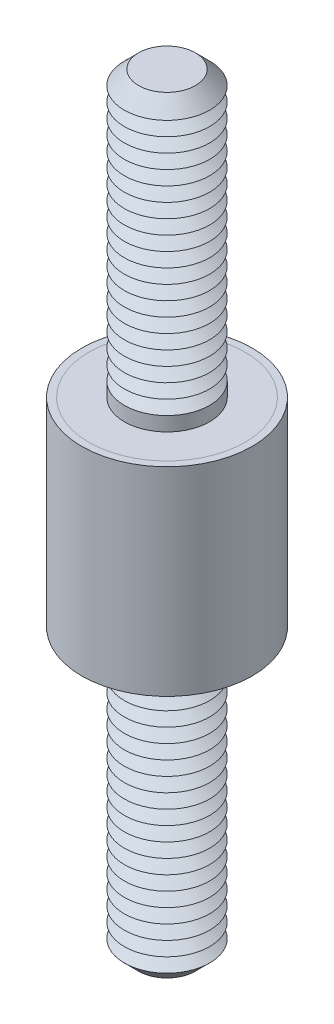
ISO-10303-21;
HEADER;
FILE_DESCRIPTION(('STEP AP214'),'2;1');
FILE_NAME('part.step','',(''),(''),'','','');
FILE_SCHEMA(('AUTOMOTIVE_DESIGN { 1 0 10303 214 1 1 1 1 }'));
ENDSEC;
DATA;
#1=APPLICATION_CONTEXT('core data for automotive mechanical design processes');
#2=APPLICATION_PROTOCOL_DEFINITION('international standard','automotive_design',2000,#1);
#3=PRODUCT_CONTEXT('',#1,'mechanical');
#4=PRODUCT('Part','Part','',(#3));
#5=PRODUCT_RELATED_PRODUCT_CATEGORY('part','',(#4));
#6=PRODUCT_DEFINITION_FORMATION('','',#4);
#7=PRODUCT_DEFINITION_CONTEXT('part definition',#1,'design');
#8=PRODUCT_DEFINITION('design','',#6,#7);
#9=PRODUCT_DEFINITION_SHAPE('','',#8);
#10=(LENGTH_UNIT() NAMED_UNIT(*) SI_UNIT(.MILLI.,.METRE.));
#11=(NAMED_UNIT(*) PLANE_ANGLE_UNIT() SI_UNIT($,.RADIAN.));
#12=(NAMED_UNIT(*) SI_UNIT($,.STERADIAN.) SOLID_ANGLE_UNIT());
#13=UNCERTAINTY_MEASURE_WITH_UNIT(LENGTH_MEASURE(1.E-05),#10,'distance_accuracy_value','');
#14=(GEOMETRIC_REPRESENTATION_CONTEXT(3) GLOBAL_UNCERTAINTY_ASSIGNED_CONTEXT((#13)) GLOBAL_UNIT_ASSIGNED_CONTEXT((#10,
#11,#12)) REPRESENTATION_CONTEXT('',''));
#15=CARTESIAN_POINT('',(0.,0.,0.));
#16=DIRECTION('',(0.,0.,1.));
#17=DIRECTION('',(1.,0.,0.));
#18=AXIS2_PLACEMENT_3D('',#15,#16,#17);
#19=CARTESIAN_POINT('',(0.,-13.5,0.));
#20=DIRECTION('',(0.,1.,0.));
#21=DIRECTION('',(0.,0.,1.));
#22=AXIS2_PLACEMENT_3D('',#19,#20,#21);
#23=CYLINDRICAL_SURFACE('',#22,1.5);
#24=CARTESIAN_POINT('',(0.,-3.5,0.));
#25=DIRECTION('',(0.,-1.,0.));
#26=DIRECTION('',(0.,0.,-1.));
#27=AXIS2_PLACEMENT_3D('',#24,#25,#26);
#28=CIRCLE('',#27,1.5);
#29=CARTESIAN_POINT('',(0.,-3.5,-1.5));
#30=VERTEX_POINT('',#29);
#31=EDGE_CURVE('P0_E21',#30,#30,#28,.T.);
#32=ORIENTED_EDGE('',*,*,#31,.T.);
#33=EDGE_LOOP('',(#32));
#34=FACE_BOUND('',#33,.T.);
#35=CARTESIAN_POINT('',(0.,-4.,0.));
#36=DIRECTION('',(0.,1.,0.));
#37=DIRECTION('',(0.,0.,1.));
#38=AXIS2_PLACEMENT_3D('',#35,#36,#37);
#39=CIRCLE('',#38,1.5);
#40=CARTESIAN_POINT('',(0.,-4.,1.5));
#41=VERTEX_POINT('',#40);
#42=EDGE_CURVE('P0_E33',#41,#41,#39,.T.);
#43=ORIENTED_EDGE('',*,*,#42,.T.);
#44=EDGE_LOOP('',(#43));
#45=FACE_BOUND('',#44,.T.);
#46=ADVANCED_FACE('P0_F14',(#34,#45),#23,.T.);
#47=CARTESIAN_POINT('',(0.,-3.5,0.));
#48=DIRECTION('',(0.,1.,0.));
#49=DIRECTION('',(0.,0.,1.));
#50=AXIS2_PLACEMENT_3D('',#47,#48,#49);
#51=CYLINDRICAL_SURFACE('',#50,2.75);
#52=CARTESIAN_POINT('',(0.,-3.5,0.));
#53=DIRECTION('',(0.,1.,0.));
#54=DIRECTION('',(0.,0.,1.));
#55=AXIS2_PLACEMENT_3D('',#52,#53,#54);
#56=CIRCLE('',#55,2.75);
#57=CARTESIAN_POINT('',(0.,-3.5,2.75));
#58=VERTEX_POINT('',#57);
#59=EDGE_CURVE('P0_E25',#58,#58,#56,.T.);
#60=ORIENTED_EDGE('',*,*,#59,.T.);
#61=EDGE_LOOP('',(#60));
#62=FACE_BOUND('',#61,.T.);
#63=CARTESIAN_POINT('',(0.,-3.,0.));
#64=DIRECTION('',(0.,1.,0.));
#65=DIRECTION('',(0.,0.,1.));
#66=AXIS2_PLACEMENT_3D('',#63,#64,#65);
#67=CIRCLE('',#66,2.75);
#68=CARTESIAN_POINT('',(0.,-3.,2.75));
#69=VERTEX_POINT('',#68);
#70=EDGE_CURVE('P0_E30',#69,#69,#67,.T.);
#71=ORIENTED_EDGE('',*,*,#70,.F.);
#72=EDGE_LOOP('',(#71));
#73=FACE_BOUND('',#72,.T.);
#74=ADVANCED_FACE('P0_F169',(#62,#73),#51,.T.);
#75=CARTESIAN_POINT('',(0.,-3.5,0.));
#76=DIRECTION('',(0.,1.,0.));
#77=DIRECTION('',(0.,0.,1.));
#78=AXIS2_PLACEMENT_3D('',#75,#76,#77);
#79=PLANE('',#78);
#80=ORIENTED_EDGE('',*,*,#31,.F.);
#81=EDGE_LOOP('',(#80));
#82=FACE_BOUND('',#81,.T.);
#83=ORIENTED_EDGE('',*,*,#59,.F.);
#84=EDGE_LOOP('',(#83));
#85=FACE_BOUND('',#84,.T.);
#86=ADVANCED_FACE('P0_F174',(#82,#85),#79,.F.);
#87=CARTESIAN_POINT('',(0.,-3.,0.));
#88=DIRECTION('',(0.,1.,0.));
#89=DIRECTION('',(0.,0.,1.));
#90=AXIS2_PLACEMENT_3D('',#87,#88,#89);
#91=PLANE('',#90);
#92=ORIENTED_EDGE('',*,*,#70,.T.);
#93=EDGE_LOOP('',(#92));
#94=FACE_BOUND('',#93,.T.);
#95=ADVANCED_FACE('P0_F180',(#94),#91,.T.);
#96=CARTESIAN_POINT('',(0.,-4.,0.));
#97=DIRECTION('',(0.,1.,0.));
#98=DIRECTION('',(0.,0.,1.));
#99=AXIS2_PLACEMENT_3D('',#96,#97,#98);
#100=CONICAL_SURFACE('',#99,1.5,1.0471975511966);
#101=CARTESIAN_POINT('',(0.,-4.25,0.));
#102=DIRECTION('',(0.,1.,0.));
#103=DIRECTION('',(0.,0.,1.));
#104=AXIS2_PLACEMENT_3D('',#101,#102,#103);
#105=CIRCLE('',#104,1.06698729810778);
#106=CARTESIAN_POINT('',(0.,-4.25,1.06698729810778));
#107=VERTEX_POINT('',#106);
#108=EDGE_CURVE('P0_E39',#107,#107,#105,.T.);
#109=ORIENTED_EDGE('',*,*,#108,.T.);
#110=EDGE_LOOP('',(#109));
#111=FACE_BOUND('',#110,.T.);
#112=ORIENTED_EDGE('',*,*,#42,.F.);
#113=EDGE_LOOP('',(#112));
#114=FACE_BOUND('',#113,.T.);
#115=ADVANCED_FACE('P0_F183',(#111,#114),#100,.T.);
#116=CARTESIAN_POINT('',(0.,-4.25,0.));
#117=DIRECTION('',(0.,-1.,0.));
#118=DIRECTION('',(0.,0.,-1.));
#119=AXIS2_PLACEMENT_3D('',#116,#117,#118);
#120=CONICAL_SURFACE('',#119,1.06698729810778,1.0471975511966);
#121=CARTESIAN_POINT('',(0.,-4.5,0.));
#122=DIRECTION('',(0.,1.,0.));
#123=DIRECTION('',(0.,0.,1.));
#124=AXIS2_PLACEMENT_3D('',#121,#122,#123);
#125=CIRCLE('',#124,1.5);
#126=CARTESIAN_POINT('',(0.,-4.5,1.5));
#127=VERTEX_POINT('',#126);
#128=EDGE_CURVE('P0_E43',#127,#127,#125,.T.);
#129=ORIENTED_EDGE('',*,*,#128,.T.);
#130=EDGE_LOOP('',(#129));
#131=FACE_BOUND('',#130,.T.);
#132=ORIENTED_EDGE('',*,*,#108,.F.);
#133=EDGE_LOOP('',(#132));
#134=FACE_BOUND('',#133,.T.);
#135=ADVANCED_FACE('P0_F187',(#131,#134),#120,.T.);
#136=CARTESIAN_POINT('',(0.,-4.5,0.));
#137=DIRECTION('',(0.,1.,0.));
#138=DIRECTION('',(0.,0.,1.));
#139=AXIS2_PLACEMENT_3D('',#136,#137,#138);
#140=CONICAL_SURFACE('',#139,1.5,1.0471975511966);
#141=CARTESIAN_POINT('',(0.,-4.75,0.));
#142=DIRECTION('',(0.,1.,0.));
#143=DIRECTION('',(0.,0.,1.));
#144=AXIS2_PLACEMENT_3D('',#141,#142,#143);
#145=CIRCLE('',#144,1.06698729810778);
#146=CARTESIAN_POINT('',(0.,-4.75,1.06698729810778));
#147=VERTEX_POINT('',#146);
#148=EDGE_CURVE('P0_E47',#147,#147,#145,.T.);
#149=ORIENTED_EDGE('',*,*,#148,.T.);
#150=EDGE_LOOP('',(#149));
#151=FACE_BOUND('',#150,.T.);
#152=ORIENTED_EDGE('',*,*,#128,.F.);
#153=EDGE_LOOP('',(#152));
#154=FACE_BOUND('',#153,.T.);
#155=ADVANCED_FACE('P0_F191',(#151,#154),#140,.T.);
#156=CARTESIAN_POINT('',(0.,-4.75,0.));
#157=DIRECTION('',(0.,-1.,0.));
#158=DIRECTION('',(0.,0.,-1.));
#159=AXIS2_PLACEMENT_3D('',#156,#157,#158);
#160=CONICAL_SURFACE('',#159,1.06698729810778,1.0471975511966);
#161=CARTESIAN_POINT('',(0.,-5.,0.));
#162=DIRECTION('',(0.,1.,0.));
#163=DIRECTION('',(0.,0.,1.));
#164=AXIS2_PLACEMENT_3D('',#161,#162,#163);
#165=CIRCLE('',#164,1.5);
#166=CARTESIAN_POINT('',(0.,-5.,1.5));
#167=VERTEX_POINT('',#166);
#168=EDGE_CURVE('P0_E52',#167,#167,#165,.T.);
#169=ORIENTED_EDGE('',*,*,#168,.T.);
#170=EDGE_LOOP('',(#169));
#171=FACE_BOUND('',#170,.T.);
#172=ORIENTED_EDGE('',*,*,#148,.F.);
#173=EDGE_LOOP('',(#172));
#174=FACE_BOUND('',#173,.T.);
#175=ADVANCED_FACE('P0_F198',(#171,#174),#160,.T.);
#176=CARTESIAN_POINT('',(0.,-5.,0.));
#177=DIRECTION('',(0.,1.,0.));
#178=DIRECTION('',(0.,0.,1.));
#179=AXIS2_PLACEMENT_3D('',#176,#177,#178);
#180=CONICAL_SURFACE('',#179,1.5,1.0471975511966);
#181=CARTESIAN_POINT('',(0.,-5.25,0.));
#182=DIRECTION('',(0.,1.,0.));
#183=DIRECTION('',(0.,0.,1.));
#184=AXIS2_PLACEMENT_3D('',#181,#182,#183);
#185=CIRCLE('',#184,1.06698729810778);
#186=CARTESIAN_POINT('',(0.,-5.25,1.06698729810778));
#187=VERTEX_POINT('',#186);
#188=EDGE_CURVE('P0_E55',#187,#187,#185,.T.);
#189=ORIENTED_EDGE('',*,*,#188,.T.);
#190=EDGE_LOOP('',(#189));
#191=FACE_BOUND('',#190,.T.);
#192=ORIENTED_EDGE('',*,*,#168,.F.);
#193=EDGE_LOOP('',(#192));
#194=FACE_BOUND('',#193,.T.);
#195=ADVANCED_FACE('P0_F202',(#191,#194),#180,.T.);
#196=CARTESIAN_POINT('',(0.,-5.25,0.));
#197=DIRECTION('',(0.,-1.,0.));
#198=DIRECTION('',(0.,0.,-1.));
#199=AXIS2_PLACEMENT_3D('',#196,#197,#198);
#200=CONICAL_SURFACE('',#199,1.06698729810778,1.0471975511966);
#201=CARTESIAN_POINT('',(0.,-5.5,0.));
#202=DIRECTION('',(0.,1.,0.));
#203=DIRECTION('',(0.,0.,1.));
#204=AXIS2_PLACEMENT_3D('',#201,#202,#203);
#205=CIRCLE('',#204,1.5);
#206=CARTESIAN_POINT('',(0.,-5.5,1.5));
#207=VERTEX_POINT('',#206);
#208=EDGE_CURVE('P0_E58',#207,#207,#205,.T.);
#209=ORIENTED_EDGE('',*,*,#208,.T.);
#210=EDGE_LOOP('',(#209));
#211=FACE_BOUND('',#210,.T.);
#212=ORIENTED_EDGE('',*,*,#188,.F.);
#213=EDGE_LOOP('',(#212));
#214=FACE_BOUND('',#213,.T.);
#215=ADVANCED_FACE('P0_F206',(#211,#214),#200,.T.);
#216=CARTESIAN_POINT('',(0.,-5.5,0.));
#217=DIRECTION('',(0.,1.,0.));
#218=DIRECTION('',(0.,0.,1.));
#219=AXIS2_PLACEMENT_3D('',#216,#217,#218);
#220=CONICAL_SURFACE('',#219,1.5,1.0471975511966);
#221=CARTESIAN_POINT('',(0.,-5.75,0.));
#222=DIRECTION('',(0.,1.,0.));
#223=DIRECTION('',(0.,0.,1.));
#224=AXIS2_PLACEMENT_3D('',#221,#222,#223);
#225=CIRCLE('',#224,1.06698729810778);
#226=CARTESIAN_POINT('',(0.,-5.75,1.06698729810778));
#227=VERTEX_POINT('',#226);
#228=EDGE_CURVE('P0_E61',#227,#227,#225,.T.);
#229=ORIENTED_EDGE('',*,*,#228,.T.);
#230=EDGE_LOOP('',(#229));
#231=FACE_BOUND('',#230,.T.);
#232=ORIENTED_EDGE('',*,*,#208,.F.);
#233=EDGE_LOOP('',(#232));
#234=FACE_BOUND('',#233,.T.);
#235=ADVANCED_FACE('P0_F210',(#231,#234),#220,.T.);
#236=CARTESIAN_POINT('',(0.,-5.75,0.));
#237=DIRECTION('',(0.,-1.,0.));
#238=DIRECTION('',(0.,0.,-1.));
#239=AXIS2_PLACEMENT_3D('',#236,#237,#238);
#240=CONICAL_SURFACE('',#239,1.06698729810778,1.0471975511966);
#241=CARTESIAN_POINT('',(0.,-6.,0.));
#242=DIRECTION('',(0.,1.,0.));
#243=DIRECTION('',(0.,0.,1.));
#244=AXIS2_PLACEMENT_3D('',#241,#242,#243);
#245=CIRCLE('',#244,1.5);
#246=CARTESIAN_POINT('',(0.,-6.,1.5));
#247=VERTEX_POINT('',#246);
#248=EDGE_CURVE('P0_E64',#247,#247,#245,.T.);
#249=ORIENTED_EDGE('',*,*,#248,.T.);
#250=EDGE_LOOP('',(#249));
#251=FACE_BOUND('',#250,.T.);
#252=ORIENTED_EDGE('',*,*,#228,.F.);
#253=EDGE_LOOP('',(#252));
#254=FACE_BOUND('',#253,.T.);
#255=ADVANCED_FACE('P0_F214',(#251,#254),#240,.T.);
#256=CARTESIAN_POINT('',(0.,-6.,0.));
#257=DIRECTION('',(0.,1.,0.));
#258=DIRECTION('',(0.,0.,1.));
#259=AXIS2_PLACEMENT_3D('',#256,#257,#258);
#260=CONICAL_SURFACE('',#259,1.5,1.0471975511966);
#261=CARTESIAN_POINT('',(0.,-6.25,0.));
#262=DIRECTION('',(0.,1.,0.));
#263=DIRECTION('',(0.,0.,1.));
#264=AXIS2_PLACEMENT_3D('',#261,#262,#263);
#265=CIRCLE('',#264,1.06698729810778);
#266=CARTESIAN_POINT('',(0.,-6.25,1.06698729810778));
#267=VERTEX_POINT('',#266);
#268=EDGE_CURVE('P0_E67',#267,#267,#265,.T.);
#269=ORIENTED_EDGE('',*,*,#268,.T.);
#270=EDGE_LOOP('',(#269));
#271=FACE_BOUND('',#270,.T.);
#272=ORIENTED_EDGE('',*,*,#248,.F.);
#273=EDGE_LOOP('',(#272));
#274=FACE_BOUND('',#273,.T.);
#275=ADVANCED_FACE('P0_F218',(#271,#274),#260,.T.);
#276=CARTESIAN_POINT('',(0.,-6.25,0.));
#277=DIRECTION('',(0.,-1.,0.));
#278=DIRECTION('',(0.,0.,-1.));
#279=AXIS2_PLACEMENT_3D('',#276,#277,#278);
#280=CONICAL_SURFACE('',#279,1.06698729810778,1.0471975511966);
#281=CARTESIAN_POINT('',(0.,-6.5,0.));
#282=DIRECTION('',(0.,1.,0.));
#283=DIRECTION('',(0.,0.,1.));
#284=AXIS2_PLACEMENT_3D('',#281,#282,#283);
#285=CIRCLE('',#284,1.5);
#286=CARTESIAN_POINT('',(0.,-6.5,1.5));
#287=VERTEX_POINT('',#286);
#288=EDGE_CURVE('P0_E70',#287,#287,#285,.T.);
#289=ORIENTED_EDGE('',*,*,#288,.T.);
#290=EDGE_LOOP('',(#289));
#291=FACE_BOUND('',#290,.T.);
#292=ORIENTED_EDGE('',*,*,#268,.F.);
#293=EDGE_LOOP('',(#292));
#294=FACE_BOUND('',#293,.T.);
#295=ADVANCED_FACE('P0_F222',(#291,#294),#280,.T.);
#296=CARTESIAN_POINT('',(0.,-6.5,0.));
#297=DIRECTION('',(0.,1.,0.));
#298=DIRECTION('',(0.,0.,1.));
#299=AXIS2_PLACEMENT_3D('',#296,#297,#298);
#300=CONICAL_SURFACE('',#299,1.5,1.0471975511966);
#301=CARTESIAN_POINT('',(0.,-6.75,0.));
#302=DIRECTION('',(0.,1.,0.));
#303=DIRECTION('',(0.,0.,1.));
#304=AXIS2_PLACEMENT_3D('',#301,#302,#303);
#305=CIRCLE('',#304,1.06698729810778);
#306=CARTESIAN_POINT('',(0.,-6.75,1.06698729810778));
#307=VERTEX_POINT('',#306);
#308=EDGE_CURVE('P0_E73',#307,#307,#305,.T.);
#309=ORIENTED_EDGE('',*,*,#308,.T.);
#310=EDGE_LOOP('',(#309));
#311=FACE_BOUND('',#310,.T.);
#312=ORIENTED_EDGE('',*,*,#288,.F.);
#313=EDGE_LOOP('',(#312));
#314=FACE_BOUND('',#313,.T.);
#315=ADVANCED_FACE('P0_F226',(#311,#314),#300,.T.);
#316=CARTESIAN_POINT('',(0.,-6.75,0.));
#317=DIRECTION('',(0.,-1.,0.));
#318=DIRECTION('',(0.,0.,-1.));
#319=AXIS2_PLACEMENT_3D('',#316,#317,#318);
#320=CONICAL_SURFACE('',#319,1.06698729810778,1.0471975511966);
#321=CARTESIAN_POINT('',(0.,-7.,0.));
#322=DIRECTION('',(0.,1.,0.));
#323=DIRECTION('',(0.,0.,1.));
#324=AXIS2_PLACEMENT_3D('',#321,#322,#323);
#325=CIRCLE('',#324,1.5);
#326=CARTESIAN_POINT('',(0.,-7.,1.5));
#327=VERTEX_POINT('',#326);
#328=EDGE_CURVE('P0_E76',#327,#327,#325,.T.);
#329=ORIENTED_EDGE('',*,*,#328,.T.);
#330=EDGE_LOOP('',(#329));
#331=FACE_BOUND('',#330,.T.);
#332=ORIENTED_EDGE('',*,*,#308,.F.);
#333=EDGE_LOOP('',(#332));
#334=FACE_BOUND('',#333,.T.);
#335=ADVANCED_FACE('P0_F230',(#331,#334),#320,.T.);
#336=CARTESIAN_POINT('',(0.,-7.,0.));
#337=DIRECTION('',(0.,1.,0.));
#338=DIRECTION('',(0.,0.,1.));
#339=AXIS2_PLACEMENT_3D('',#336,#337,#338);
#340=CONICAL_SURFACE('',#339,1.5,1.0471975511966);
#341=CARTESIAN_POINT('',(0.,-7.25,0.));
#342=DIRECTION('',(0.,1.,0.));
#343=DIRECTION('',(0.,0.,1.));
#344=AXIS2_PLACEMENT_3D('',#341,#342,#343);
#345=CIRCLE('',#344,1.06698729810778);
#346=CARTESIAN_POINT('',(0.,-7.25,1.06698729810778));
#347=VERTEX_POINT('',#346);
#348=EDGE_CURVE('P0_E79',#347,#347,#345,.T.);
#349=ORIENTED_EDGE('',*,*,#348,.T.);
#350=EDGE_LOOP('',(#349));
#351=FACE_BOUND('',#350,.T.);
#352=ORIENTED_EDGE('',*,*,#328,.F.);
#353=EDGE_LOOP('',(#352));
#354=FACE_BOUND('',#353,.T.);
#355=ADVANCED_FACE('P0_F234',(#351,#354),#340,.T.);
#356=CARTESIAN_POINT('',(0.,-7.25,0.));
#357=DIRECTION('',(0.,-1.,0.));
#358=DIRECTION('',(0.,0.,-1.));
#359=AXIS2_PLACEMENT_3D('',#356,#357,#358);
#360=CONICAL_SURFACE('',#359,1.06698729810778,1.0471975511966);
#361=CARTESIAN_POINT('',(0.,-7.5,0.));
#362=DIRECTION('',(0.,1.,0.));
#363=DIRECTION('',(0.,0.,1.));
#364=AXIS2_PLACEMENT_3D('',#361,#362,#363);
#365=CIRCLE('',#364,1.5);
#366=CARTESIAN_POINT('',(0.,-7.5,1.5));
#367=VERTEX_POINT('',#366);
#368=EDGE_CURVE('P0_E82',#367,#367,#365,.T.);
#369=ORIENTED_EDGE('',*,*,#368,.T.);
#370=EDGE_LOOP('',(#369));
#371=FACE_BOUND('',#370,.T.);
#372=ORIENTED_EDGE('',*,*,#348,.F.);
#373=EDGE_LOOP('',(#372));
#374=FACE_BOUND('',#373,.T.);
#375=ADVANCED_FACE('P0_F238',(#371,#374),#360,.T.);
#376=CARTESIAN_POINT('',(0.,-7.5,0.));
#377=DIRECTION('',(0.,1.,0.));
#378=DIRECTION('',(0.,0.,1.));
#379=AXIS2_PLACEMENT_3D('',#376,#377,#378);
#380=CONICAL_SURFACE('',#379,1.5,1.0471975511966);
#381=CARTESIAN_POINT('',(0.,-7.75,0.));
#382=DIRECTION('',(0.,1.,0.));
#383=DIRECTION('',(0.,0.,1.));
#384=AXIS2_PLACEMENT_3D('',#381,#382,#383);
#385=CIRCLE('',#384,1.06698729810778);
#386=CARTESIAN_POINT('',(0.,-7.75,1.06698729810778));
#387=VERTEX_POINT('',#386);
#388=EDGE_CURVE('P0_E85',#387,#387,#385,.T.);
#389=ORIENTED_EDGE('',*,*,#388,.T.);
#390=EDGE_LOOP('',(#389));
#391=FACE_BOUND('',#390,.T.);
#392=ORIENTED_EDGE('',*,*,#368,.F.);
#393=EDGE_LOOP('',(#392));
#394=FACE_BOUND('',#393,.T.);
#395=ADVANCED_FACE('P0_F242',(#391,#394),#380,.T.);
#396=CARTESIAN_POINT('',(0.,-7.75,0.));
#397=DIRECTION('',(0.,-1.,0.));
#398=DIRECTION('',(0.,0.,-1.));
#399=AXIS2_PLACEMENT_3D('',#396,#397,#398);
#400=CONICAL_SURFACE('',#399,1.06698729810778,1.0471975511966);
#401=CARTESIAN_POINT('',(0.,-8.,0.));
#402=DIRECTION('',(0.,1.,0.));
#403=DIRECTION('',(0.,0.,1.));
#404=AXIS2_PLACEMENT_3D('',#401,#402,#403);
#405=CIRCLE('',#404,1.5);
#406=CARTESIAN_POINT('',(0.,-8.,1.5));
#407=VERTEX_POINT('',#406);
#408=EDGE_CURVE('P0_E88',#407,#407,#405,.T.);
#409=ORIENTED_EDGE('',*,*,#408,.T.);
#410=EDGE_LOOP('',(#409));
#411=FACE_BOUND('',#410,.T.);
#412=ORIENTED_EDGE('',*,*,#388,.F.);
#413=EDGE_LOOP('',(#412));
#414=FACE_BOUND('',#413,.T.);
#415=ADVANCED_FACE('P0_F246',(#411,#414),#400,.T.);
#416=CARTESIAN_POINT('',(0.,-8.,0.));
#417=DIRECTION('',(0.,1.,0.));
#418=DIRECTION('',(0.,0.,1.));
#419=AXIS2_PLACEMENT_3D('',#416,#417,#418);
#420=CONICAL_SURFACE('',#419,1.5,1.0471975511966);
#421=CARTESIAN_POINT('',(0.,-8.25,0.));
#422=DIRECTION('',(0.,1.,0.));
#423=DIRECTION('',(0.,0.,1.));
#424=AXIS2_PLACEMENT_3D('',#421,#422,#423);
#425=CIRCLE('',#424,1.06698729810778);
#426=CARTESIAN_POINT('',(0.,-8.25,1.06698729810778));
#427=VERTEX_POINT('',#426);
#428=EDGE_CURVE('P0_E91',#427,#427,#425,.T.);
#429=ORIENTED_EDGE('',*,*,#428,.T.);
#430=EDGE_LOOP('',(#429));
#431=FACE_BOUND('',#430,.T.);
#432=ORIENTED_EDGE('',*,*,#408,.F.);
#433=EDGE_LOOP('',(#432));
#434=FACE_BOUND('',#433,.T.);
#435=ADVANCED_FACE('P0_F250',(#431,#434),#420,.T.);
#436=CARTESIAN_POINT('',(0.,-8.25,0.));
#437=DIRECTION('',(0.,-1.,0.));
#438=DIRECTION('',(0.,0.,-1.));
#439=AXIS2_PLACEMENT_3D('',#436,#437,#438);
#440=CONICAL_SURFACE('',#439,1.06698729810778,1.0471975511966);
#441=CARTESIAN_POINT('',(0.,-8.5,0.));
#442=DIRECTION('',(0.,1.,0.));
#443=DIRECTION('',(0.,0.,1.));
#444=AXIS2_PLACEMENT_3D('',#441,#442,#443);
#445=CIRCLE('',#444,1.5);
#446=CARTESIAN_POINT('',(0.,-8.5,1.5));
#447=VERTEX_POINT('',#446);
#448=EDGE_CURVE('P0_E94',#447,#447,#445,.T.);
#449=ORIENTED_EDGE('',*,*,#448,.T.);
#450=EDGE_LOOP('',(#449));
#451=FACE_BOUND('',#450,.T.);
#452=ORIENTED_EDGE('',*,*,#428,.F.);
#453=EDGE_LOOP('',(#452));
#454=FACE_BOUND('',#453,.T.);
#455=ADVANCED_FACE('P0_F254',(#451,#454),#440,.T.);
#456=CARTESIAN_POINT('',(0.,-8.5,0.));
#457=DIRECTION('',(0.,1.,0.));
#458=DIRECTION('',(0.,0.,1.));
#459=AXIS2_PLACEMENT_3D('',#456,#457,#458);
#460=CONICAL_SURFACE('',#459,1.5,1.0471975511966);
#461=CARTESIAN_POINT('',(0.,-8.75,0.));
#462=DIRECTION('',(0.,1.,0.));
#463=DIRECTION('',(0.,0.,1.));
#464=AXIS2_PLACEMENT_3D('',#461,#462,#463);
#465=CIRCLE('',#464,1.06698729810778);
#466=CARTESIAN_POINT('',(0.,-8.75,1.06698729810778));
#467=VERTEX_POINT('',#466);
#468=EDGE_CURVE('P0_E97',#467,#467,#465,.T.);
#469=ORIENTED_EDGE('',*,*,#468,.T.);
#470=EDGE_LOOP('',(#469));
#471=FACE_BOUND('',#470,.T.);
#472=ORIENTED_EDGE('',*,*,#448,.F.);
#473=EDGE_LOOP('',(#472));
#474=FACE_BOUND('',#473,.T.);
#475=ADVANCED_FACE('P0_F258',(#471,#474),#460,.T.);
#476=CARTESIAN_POINT('',(0.,-8.75,0.));
#477=DIRECTION('',(0.,-1.,0.));
#478=DIRECTION('',(0.,0.,-1.));
#479=AXIS2_PLACEMENT_3D('',#476,#477,#478);
#480=CONICAL_SURFACE('',#479,1.06698729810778,1.0471975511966);
#481=CARTESIAN_POINT('',(0.,-9.,0.));
#482=DIRECTION('',(0.,1.,0.));
#483=DIRECTION('',(0.,0.,1.));
#484=AXIS2_PLACEMENT_3D('',#481,#482,#483);
#485=CIRCLE('',#484,1.5);
#486=CARTESIAN_POINT('',(0.,-9.,1.5));
#487=VERTEX_POINT('',#486);
#488=EDGE_CURVE('P0_E100',#487,#487,#485,.T.);
#489=ORIENTED_EDGE('',*,*,#488,.T.);
#490=EDGE_LOOP('',(#489));
#491=FACE_BOUND('',#490,.T.);
#492=ORIENTED_EDGE('',*,*,#468,.F.);
#493=EDGE_LOOP('',(#492));
#494=FACE_BOUND('',#493,.T.);
#495=ADVANCED_FACE('P0_F262',(#491,#494),#480,.T.);
#496=CARTESIAN_POINT('',(0.,-9.,0.));
#497=DIRECTION('',(0.,1.,0.));
#498=DIRECTION('',(0.,0.,1.));
#499=AXIS2_PLACEMENT_3D('',#496,#497,#498);
#500=CONICAL_SURFACE('',#499,1.5,1.0471975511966);
#501=CARTESIAN_POINT('',(0.,-9.25,0.));
#502=DIRECTION('',(0.,1.,0.));
#503=DIRECTION('',(0.,0.,1.));
#504=AXIS2_PLACEMENT_3D('',#501,#502,#503);
#505=CIRCLE('',#504,1.06698729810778);
#506=CARTESIAN_POINT('',(0.,-9.25,1.06698729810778));
#507=VERTEX_POINT('',#506);
#508=EDGE_CURVE('P0_E103',#507,#507,#505,.T.);
#509=ORIENTED_EDGE('',*,*,#508,.T.);
#510=EDGE_LOOP('',(#509));
#511=FACE_BOUND('',#510,.T.);
#512=ORIENTED_EDGE('',*,*,#488,.F.);
#513=EDGE_LOOP('',(#512));
#514=FACE_BOUND('',#513,.T.);
#515=ADVANCED_FACE('P0_F266',(#511,#514),#500,.T.);
#516=CARTESIAN_POINT('',(0.,-9.25,0.));
#517=DIRECTION('',(0.,-1.,0.));
#518=DIRECTION('',(0.,0.,-1.));
#519=AXIS2_PLACEMENT_3D('',#516,#517,#518);
#520=CONICAL_SURFACE('',#519,1.06698729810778,1.0471975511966);
#521=CARTESIAN_POINT('',(0.,-9.5,0.));
#522=DIRECTION('',(0.,1.,0.));
#523=DIRECTION('',(0.,0.,1.));
#524=AXIS2_PLACEMENT_3D('',#521,#522,#523);
#525=CIRCLE('',#524,1.5);
#526=CARTESIAN_POINT('',(0.,-9.5,1.5));
#527=VERTEX_POINT('',#526);
#528=EDGE_CURVE('P0_E106',#527,#527,#525,.T.);
#529=ORIENTED_EDGE('',*,*,#528,.T.);
#530=EDGE_LOOP('',(#529));
#531=FACE_BOUND('',#530,.T.);
#532=ORIENTED_EDGE('',*,*,#508,.F.);
#533=EDGE_LOOP('',(#532));
#534=FACE_BOUND('',#533,.T.);
#535=ADVANCED_FACE('P0_F270',(#531,#534),#520,.T.);
#536=CARTESIAN_POINT('',(0.,-9.5,0.));
#537=DIRECTION('',(0.,1.,0.));
#538=DIRECTION('',(0.,0.,1.));
#539=AXIS2_PLACEMENT_3D('',#536,#537,#538);
#540=CONICAL_SURFACE('',#539,1.5,1.0471975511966);
#541=CARTESIAN_POINT('',(0.,-9.75,0.));
#542=DIRECTION('',(0.,1.,0.));
#543=DIRECTION('',(0.,0.,1.));
#544=AXIS2_PLACEMENT_3D('',#541,#542,#543);
#545=CIRCLE('',#544,1.06698729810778);
#546=CARTESIAN_POINT('',(0.,-9.75,1.06698729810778));
#547=VERTEX_POINT('',#546);
#548=EDGE_CURVE('P0_E109',#547,#547,#545,.T.);
#549=ORIENTED_EDGE('',*,*,#548,.T.);
#550=EDGE_LOOP('',(#549));
#551=FACE_BOUND('',#550,.T.);
#552=ORIENTED_EDGE('',*,*,#528,.F.);
#553=EDGE_LOOP('',(#552));
#554=FACE_BOUND('',#553,.T.);
#555=ADVANCED_FACE('P0_F274',(#551,#554),#540,.T.);
#556=CARTESIAN_POINT('',(0.,-9.75,0.));
#557=DIRECTION('',(0.,-1.,0.));
#558=DIRECTION('',(0.,0.,-1.));
#559=AXIS2_PLACEMENT_3D('',#556,#557,#558);
#560=CONICAL_SURFACE('',#559,1.06698729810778,1.0471975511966);
#561=CARTESIAN_POINT('',(0.,-10.,0.));
#562=DIRECTION('',(0.,1.,0.));
#563=DIRECTION('',(0.,0.,1.));
#564=AXIS2_PLACEMENT_3D('',#561,#562,#563);
#565=CIRCLE('',#564,1.5);
#566=CARTESIAN_POINT('',(0.,-10.,1.5));
#567=VERTEX_POINT('',#566);
#568=EDGE_CURVE('P0_E112',#567,#567,#565,.T.);
#569=ORIENTED_EDGE('',*,*,#568,.T.);
#570=EDGE_LOOP('',(#569));
#571=FACE_BOUND('',#570,.T.);
#572=ORIENTED_EDGE('',*,*,#548,.F.);
#573=EDGE_LOOP('',(#572));
#574=FACE_BOUND('',#573,.T.);
#575=ADVANCED_FACE('P0_F278',(#571,#574),#560,.T.);
#576=CARTESIAN_POINT('',(0.,-10.,0.));
#577=DIRECTION('',(0.,1.,0.));
#578=DIRECTION('',(0.,0.,1.));
#579=AXIS2_PLACEMENT_3D('',#576,#577,#578);
#580=CONICAL_SURFACE('',#579,1.5,1.0471975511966);
#581=CARTESIAN_POINT('',(0.,-10.25,0.));
#582=DIRECTION('',(0.,1.,0.));
#583=DIRECTION('',(0.,0.,1.));
#584=AXIS2_PLACEMENT_3D('',#581,#582,#583);
#585=CIRCLE('',#584,1.06698729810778);
#586=CARTESIAN_POINT('',(0.,-10.25,1.06698729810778));
#587=VERTEX_POINT('',#586);
#588=EDGE_CURVE('P0_E115',#587,#587,#585,.T.);
#589=ORIENTED_EDGE('',*,*,#588,.T.);
#590=EDGE_LOOP('',(#589));
#591=FACE_BOUND('',#590,.T.);
#592=ORIENTED_EDGE('',*,*,#568,.F.);
#593=EDGE_LOOP('',(#592));
#594=FACE_BOUND('',#593,.T.);
#595=ADVANCED_FACE('P0_F282',(#591,#594),#580,.T.);
#596=CARTESIAN_POINT('',(0.,-10.25,0.));
#597=DIRECTION('',(0.,-1.,0.));
#598=DIRECTION('',(0.,0.,-1.));
#599=AXIS2_PLACEMENT_3D('',#596,#597,#598);
#600=CONICAL_SURFACE('',#599,1.06698729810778,1.0471975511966);
#601=CARTESIAN_POINT('',(0.,-10.5,0.));
#602=DIRECTION('',(0.,1.,0.));
#603=DIRECTION('',(0.,0.,1.));
#604=AXIS2_PLACEMENT_3D('',#601,#602,#603);
#605=CIRCLE('',#604,1.5);
#606=CARTESIAN_POINT('',(0.,-10.5,1.5));
#607=VERTEX_POINT('',#606);
#608=EDGE_CURVE('P0_E118',#607,#607,#605,.T.);
#609=ORIENTED_EDGE('',*,*,#608,.T.);
#610=EDGE_LOOP('',(#609));
#611=FACE_BOUND('',#610,.T.);
#612=ORIENTED_EDGE('',*,*,#588,.F.);
#613=EDGE_LOOP('',(#612));
#614=FACE_BOUND('',#613,.T.);
#615=ADVANCED_FACE('P0_F286',(#611,#614),#600,.T.);
#616=CARTESIAN_POINT('',(0.,-10.5,0.));
#617=DIRECTION('',(0.,1.,0.));
#618=DIRECTION('',(0.,0.,1.));
#619=AXIS2_PLACEMENT_3D('',#616,#617,#618);
#620=CONICAL_SURFACE('',#619,1.5,1.0471975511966);
#621=CARTESIAN_POINT('',(0.,-10.75,0.));
#622=DIRECTION('',(0.,1.,0.));
#623=DIRECTION('',(0.,0.,1.));
#624=AXIS2_PLACEMENT_3D('',#621,#622,#623);
#625=CIRCLE('',#624,1.06698729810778);
#626=CARTESIAN_POINT('',(0.,-10.75,1.06698729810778));
#627=VERTEX_POINT('',#626);
#628=EDGE_CURVE('P0_E121',#627,#627,#625,.T.);
#629=ORIENTED_EDGE('',*,*,#628,.T.);
#630=EDGE_LOOP('',(#629));
#631=FACE_BOUND('',#630,.T.);
#632=ORIENTED_EDGE('',*,*,#608,.F.);
#633=EDGE_LOOP('',(#632));
#634=FACE_BOUND('',#633,.T.);
#635=ADVANCED_FACE('P0_F290',(#631,#634),#620,.T.);
#636=CARTESIAN_POINT('',(0.,-10.75,0.));
#637=DIRECTION('',(0.,-1.,0.));
#638=DIRECTION('',(0.,0.,-1.));
#639=AXIS2_PLACEMENT_3D('',#636,#637,#638);
#640=CONICAL_SURFACE('',#639,1.06698729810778,1.0471975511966);
#641=CARTESIAN_POINT('',(0.,-11.,0.));
#642=DIRECTION('',(0.,1.,0.));
#643=DIRECTION('',(0.,0.,1.));
#644=AXIS2_PLACEMENT_3D('',#641,#642,#643);
#645=CIRCLE('',#644,1.5);
#646=CARTESIAN_POINT('',(0.,-11.,1.5));
#647=VERTEX_POINT('',#646);
#648=EDGE_CURVE('P0_E124',#647,#647,#645,.T.);
#649=ORIENTED_EDGE('',*,*,#648,.T.);
#650=EDGE_LOOP('',(#649));
#651=FACE_BOUND('',#650,.T.);
#652=ORIENTED_EDGE('',*,*,#628,.F.);
#653=EDGE_LOOP('',(#652));
#654=FACE_BOUND('',#653,.T.);
#655=ADVANCED_FACE('P0_F294',(#651,#654),#640,.T.);
#656=CARTESIAN_POINT('',(0.,-11.,0.));
#657=DIRECTION('',(0.,1.,0.));
#658=DIRECTION('',(0.,0.,1.));
#659=AXIS2_PLACEMENT_3D('',#656,#657,#658);
#660=CONICAL_SURFACE('',#659,1.5,1.0471975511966);
#661=CARTESIAN_POINT('',(0.,-11.25,0.));
#662=DIRECTION('',(0.,1.,0.));
#663=DIRECTION('',(0.,0.,1.));
#664=AXIS2_PLACEMENT_3D('',#661,#662,#663);
#665=CIRCLE('',#664,1.06698729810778);
#666=CARTESIAN_POINT('',(0.,-11.25,1.06698729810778));
#667=VERTEX_POINT('',#666);
#668=EDGE_CURVE('P0_E127',#667,#667,#665,.T.);
#669=ORIENTED_EDGE('',*,*,#668,.T.);
#670=EDGE_LOOP('',(#669));
#671=FACE_BOUND('',#670,.T.);
#672=ORIENTED_EDGE('',*,*,#648,.F.);
#673=EDGE_LOOP('',(#672));
#674=FACE_BOUND('',#673,.T.);
#675=ADVANCED_FACE('P0_F298',(#671,#674),#660,.T.);
#676=CARTESIAN_POINT('',(0.,-11.25,0.));
#677=DIRECTION('',(0.,-1.,0.));
#678=DIRECTION('',(0.,0.,-1.));
#679=AXIS2_PLACEMENT_3D('',#676,#677,#678);
#680=CONICAL_SURFACE('',#679,1.06698729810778,1.0471975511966);
#681=CARTESIAN_POINT('',(0.,-11.5,0.));
#682=DIRECTION('',(0.,1.,0.));
#683=DIRECTION('',(0.,0.,1.));
#684=AXIS2_PLACEMENT_3D('',#681,#682,#683);
#685=CIRCLE('',#684,1.5);
#686=CARTESIAN_POINT('',(0.,-11.5,1.5));
#687=VERTEX_POINT('',#686);
#688=EDGE_CURVE('P0_E130',#687,#687,#685,.T.);
#689=ORIENTED_EDGE('',*,*,#688,.T.);
#690=EDGE_LOOP('',(#689));
#691=FACE_BOUND('',#690,.T.);
#692=ORIENTED_EDGE('',*,*,#668,.F.);
#693=EDGE_LOOP('',(#692));
#694=FACE_BOUND('',#693,.T.);
#695=ADVANCED_FACE('P0_F302',(#691,#694),#680,.T.);
#696=CARTESIAN_POINT('',(0.,-11.5,0.));
#697=DIRECTION('',(0.,1.,0.));
#698=DIRECTION('',(0.,0.,1.));
#699=AXIS2_PLACEMENT_3D('',#696,#697,#698);
#700=CONICAL_SURFACE('',#699,1.5,1.0471975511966);
#701=CARTESIAN_POINT('',(0.,-11.75,0.));
#702=DIRECTION('',(0.,1.,0.));
#703=DIRECTION('',(0.,0.,1.));
#704=AXIS2_PLACEMENT_3D('',#701,#702,#703);
#705=CIRCLE('',#704,1.06698729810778);
#706=CARTESIAN_POINT('',(0.,-11.75,1.06698729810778));
#707=VERTEX_POINT('',#706);
#708=EDGE_CURVE('P0_E133',#707,#707,#705,.T.);
#709=ORIENTED_EDGE('',*,*,#708,.T.);
#710=EDGE_LOOP('',(#709));
#711=FACE_BOUND('',#710,.T.);
#712=ORIENTED_EDGE('',*,*,#688,.F.);
#713=EDGE_LOOP('',(#712));
#714=FACE_BOUND('',#713,.T.);
#715=ADVANCED_FACE('P0_F306',(#711,#714),#700,.T.);
#716=CARTESIAN_POINT('',(0.,-11.75,0.));
#717=DIRECTION('',(0.,-1.,0.));
#718=DIRECTION('',(0.,0.,-1.));
#719=AXIS2_PLACEMENT_3D('',#716,#717,#718);
#720=CONICAL_SURFACE('',#719,1.06698729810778,1.0471975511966);
#721=CARTESIAN_POINT('',(0.,-12.,0.));
#722=DIRECTION('',(0.,1.,0.));
#723=DIRECTION('',(0.,0.,1.));
#724=AXIS2_PLACEMENT_3D('',#721,#722,#723);
#725=CIRCLE('',#724,1.5);
#726=CARTESIAN_POINT('',(0.,-12.,1.5));
#727=VERTEX_POINT('',#726);
#728=EDGE_CURVE('P0_E136',#727,#727,#725,.T.);
#729=ORIENTED_EDGE('',*,*,#728,.T.);
#730=EDGE_LOOP('',(#729));
#731=FACE_BOUND('',#730,.T.);
#732=ORIENTED_EDGE('',*,*,#708,.F.);
#733=EDGE_LOOP('',(#732));
#734=FACE_BOUND('',#733,.T.);
#735=ADVANCED_FACE('P0_F310',(#731,#734),#720,.T.);
#736=CARTESIAN_POINT('',(0.,-12.,0.));
#737=DIRECTION('',(0.,1.,0.));
#738=DIRECTION('',(0.,0.,1.));
#739=AXIS2_PLACEMENT_3D('',#736,#737,#738);
#740=CONICAL_SURFACE('',#739,1.5,1.0471975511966);
#741=CARTESIAN_POINT('',(0.,-12.25,0.));
#742=DIRECTION('',(0.,1.,0.));
#743=DIRECTION('',(0.,0.,1.));
#744=AXIS2_PLACEMENT_3D('',#741,#742,#743);
#745=CIRCLE('',#744,1.06698729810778);
#746=CARTESIAN_POINT('',(0.,-12.25,1.06698729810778));
#747=VERTEX_POINT('',#746);
#748=EDGE_CURVE('P0_E139',#747,#747,#745,.T.);
#749=ORIENTED_EDGE('',*,*,#748,.T.);
#750=EDGE_LOOP('',(#749));
#751=FACE_BOUND('',#750,.T.);
#752=ORIENTED_EDGE('',*,*,#728,.F.);
#753=EDGE_LOOP('',(#752));
#754=FACE_BOUND('',#753,.T.);
#755=ADVANCED_FACE('P0_F314',(#751,#754),#740,.T.);
#756=CARTESIAN_POINT('',(0.,-12.25,0.));
#757=DIRECTION('',(0.,-1.,0.));
#758=DIRECTION('',(0.,0.,-1.));
#759=AXIS2_PLACEMENT_3D('',#756,#757,#758);
#760=CONICAL_SURFACE('',#759,1.06698729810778,1.0471975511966);
#761=CARTESIAN_POINT('',(0.,-12.5,0.));
#762=DIRECTION('',(0.,1.,0.));
#763=DIRECTION('',(0.,0.,1.));
#764=AXIS2_PLACEMENT_3D('',#761,#762,#763);
#765=CIRCLE('',#764,1.5);
#766=CARTESIAN_POINT('',(0.,-12.5,1.5));
#767=VERTEX_POINT('',#766);
#768=EDGE_CURVE('P0_E142',#767,#767,#765,.T.);
#769=ORIENTED_EDGE('',*,*,#768,.T.);
#770=EDGE_LOOP('',(#769));
#771=FACE_BOUND('',#770,.T.);
#772=ORIENTED_EDGE('',*,*,#748,.F.);
#773=EDGE_LOOP('',(#772));
#774=FACE_BOUND('',#773,.T.);
#775=ADVANCED_FACE('P0_F166',(#771,#774),#760,.T.);
#776=CARTESIAN_POINT('',(0.,-12.5,0.));
#777=DIRECTION('',(0.,1.,0.));
#778=DIRECTION('',(0.,0.,1.));
#779=AXIS2_PLACEMENT_3D('',#776,#777,#778);
#780=CONICAL_SURFACE('',#779,1.5,1.0471975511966);
#781=CARTESIAN_POINT('',(0.,-12.75,0.));
#782=DIRECTION('',(0.,1.,0.));
#783=DIRECTION('',(0.,0.,1.));
#784=AXIS2_PLACEMENT_3D('',#781,#782,#783);
#785=CIRCLE('',#784,1.06698729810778);
#786=CARTESIAN_POINT('',(0.,-12.75,1.06698729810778));
#787=VERTEX_POINT('',#786);
#788=EDGE_CURVE('P0_E148',#787,#787,#785,.T.);
#789=ORIENTED_EDGE('',*,*,#788,.T.);
#790=EDGE_LOOP('',(#789));
#791=FACE_BOUND('',#790,.T.);
#792=ORIENTED_EDGE('',*,*,#768,.F.);
#793=EDGE_LOOP('',(#792));
#794=FACE_BOUND('',#793,.T.);
#795=ADVANCED_FACE('P0_F152',(#791,#794),#780,.T.);
#796=CARTESIAN_POINT('',(0.,-12.75,0.));
#797=DIRECTION('',(0.,-1.,0.));
#798=DIRECTION('',(0.,0.,-1.));
#799=AXIS2_PLACEMENT_3D('',#796,#797,#798);
#800=CONICAL_SURFACE('',#799,1.06698729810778,1.0471975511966);
#801=CARTESIAN_POINT('',(0.,-13.,0.));
#802=DIRECTION('',(0.,1.,0.));
#803=DIRECTION('',(0.,0.,1.));
#804=AXIS2_PLACEMENT_3D('',#801,#802,#803);
#805=CIRCLE('',#804,1.5);
#806=CARTESIAN_POINT('',(0.,-13.,1.5));
#807=VERTEX_POINT('',#806);
#808=EDGE_CURVE('P0_E145',#807,#807,#805,.T.);
#809=ORIENTED_EDGE('',*,*,#808,.T.);
#810=EDGE_LOOP('',(#809));
#811=FACE_BOUND('',#810,.T.);
#812=ORIENTED_EDGE('',*,*,#788,.F.);
#813=EDGE_LOOP('',(#812));
#814=FACE_BOUND('',#813,.T.);
#815=ADVANCED_FACE('P0_F155',(#811,#814),#800,.T.);
#816=CARTESIAN_POINT('',(0.,-13.5,0.));
#817=DIRECTION('',(0.,-1.,0.));
#818=DIRECTION('',(0.,0.,-1.));
#819=AXIS2_PLACEMENT_3D('',#816,#817,#818);
#820=PLANE('',#819);
#821=CARTESIAN_POINT('',(0.,-13.5,0.));
#822=DIRECTION('',(0.,-1.,0.));
#823=DIRECTION('',(0.,0.,-1.));
#824=AXIS2_PLACEMENT_3D('',#821,#822,#823);
#825=CIRCLE('',#824,1.);
#826=CARTESIAN_POINT('',(0.,-13.5,-1.));
#827=VERTEX_POINT('',#826);
#828=EDGE_CURVE('P0_E10',#827,#827,#825,.T.);
#829=ORIENTED_EDGE('',*,*,#828,.T.);
#830=EDGE_LOOP('',(#829));
#831=FACE_BOUND('',#830,.T.);
#832=ADVANCED_FACE('P0_F157',(#831),#820,.T.);
#833=CARTESIAN_POINT('',(0.,-13.5,0.));
#834=DIRECTION('',(0.,1.,0.));
#835=DIRECTION('',(0.,0.,1.));
#836=AXIS2_PLACEMENT_3D('',#833,#834,#835);
#837=CONICAL_SURFACE('',#836,1.,0.785398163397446);
#838=ORIENTED_EDGE('',*,*,#808,.F.);
#839=EDGE_LOOP('',(#838));
#840=FACE_BOUND('',#839,.T.);
#841=ORIENTED_EDGE('',*,*,#828,.F.);
#842=EDGE_LOOP('',(#841));
#843=FACE_BOUND('',#842,.T.);
#844=ADVANCED_FACE('P0_F16',(#840,#843),#837,.T.);
#845=CLOSED_SHELL('',(#46,#74,#86,#95,#115,#135,#155,#175,#195,#215,#235,#255,#275,#295,#315,
#335,#355,#375,#395,#415,#435,#455,#475,#495,#515,#535,#555,#575,#595,#615,#635,#655,#675,#695,
#715,#735,#755,#775,#795,#815,#832,#844));
#846=MANIFOLD_SOLID_BREP('P0_B1',#845);
#847=CARTESIAN_POINT('',(0.,13.5,0.));
#848=DIRECTION('',(0.,-1.,0.));
#849=DIRECTION('',(0.,0.,-1.));
#850=AXIS2_PLACEMENT_3D('',#847,#848,#849);
#851=CYLINDRICAL_SURFACE('',#850,1.5);
#852=CARTESIAN_POINT('',(0.,4.,0.));
#853=DIRECTION('',(0.,1.,0.));
#854=DIRECTION('',(0.,0.,1.));
#855=AXIS2_PLACEMENT_3D('',#852,#853,#854);
#856=CIRCLE('',#855,1.5);
#857=CARTESIAN_POINT('',(0.,4.,1.5));
#858=VERTEX_POINT('',#857);
#859=EDGE_CURVE('P1_E33',#858,#858,#856,.T.);
#860=ORIENTED_EDGE('',*,*,#859,.F.);
#861=EDGE_LOOP('',(#860));
#862=FACE_BOUND('',#861,.T.);
#863=CARTESIAN_POINT('',(0.,3.5,0.));
#864=DIRECTION('',(0.,1.,0.));
#865=DIRECTION('',(0.,0.,1.));
#866=AXIS2_PLACEMENT_3D('',#863,#864,#865);
#867=CIRCLE('',#866,1.5);
#868=CARTESIAN_POINT('',(0.,3.5,1.5));
#869=VERTEX_POINT('',#868);
#870=EDGE_CURVE('P1_E21',#869,#869,#867,.T.);
#871=ORIENTED_EDGE('',*,*,#870,.T.);
#872=EDGE_LOOP('',(#871));
#873=FACE_BOUND('',#872,.T.);
#874=ADVANCED_FACE('P1_F14',(#862,#873),#851,.T.);
#875=CARTESIAN_POINT('',(0.,3.5,0.));
#876=DIRECTION('',(0.,-1.,0.));
#877=DIRECTION('',(0.,0.,-1.));
#878=AXIS2_PLACEMENT_3D('',#875,#876,#877);
#879=CYLINDRICAL_SURFACE('',#878,2.75);
#880=CARTESIAN_POINT('',(0.,3.5,0.));
#881=DIRECTION('',(0.,1.,0.));
#882=DIRECTION('',(0.,0.,1.));
#883=AXIS2_PLACEMENT_3D('',#880,#881,#882);
#884=CIRCLE('',#883,2.75);
#885=CARTESIAN_POINT('',(0.,3.5,2.75));
#886=VERTEX_POINT('',#885);
#887=EDGE_CURVE('P1_E25',#886,#886,#884,.T.);
#888=ORIENTED_EDGE('',*,*,#887,.F.);
#889=EDGE_LOOP('',(#888));
#890=FACE_BOUND('',#889,.T.);
#891=CARTESIAN_POINT('',(0.,3.,0.));
#892=DIRECTION('',(0.,1.,0.));
#893=DIRECTION('',(0.,0.,1.));
#894=AXIS2_PLACEMENT_3D('',#891,#892,#893);
#895=CIRCLE('',#894,2.75);
#896=CARTESIAN_POINT('',(0.,3.,2.75));
#897=VERTEX_POINT('',#896);
#898=EDGE_CURVE('P1_E30',#897,#897,#895,.T.);
#899=ORIENTED_EDGE('',*,*,#898,.T.);
#900=EDGE_LOOP('',(#899));
#901=FACE_BOUND('',#900,.T.);
#902=ADVANCED_FACE('P1_F364',(#890,#901),#879,.T.);
#903=CARTESIAN_POINT('',(0.,3.5,0.));
#904=DIRECTION('',(0.,1.,0.));
#905=DIRECTION('',(0.,0.,1.));
#906=AXIS2_PLACEMENT_3D('',#903,#904,#905);
#907=PLANE('',#906);
#908=ORIENTED_EDGE('',*,*,#870,.F.);
#909=EDGE_LOOP('',(#908));
#910=FACE_BOUND('',#909,.T.);
#911=ORIENTED_EDGE('',*,*,#887,.T.);
#912=EDGE_LOOP('',(#911));
#913=FACE_BOUND('',#912,.T.);
#914=ADVANCED_FACE('P1_F370',(#910,#913),#907,.T.);
#915=CARTESIAN_POINT('',(0.,3.,0.));
#916=DIRECTION('',(0.,1.,0.));
#917=DIRECTION('',(0.,0.,1.));
#918=AXIS2_PLACEMENT_3D('',#915,#916,#917);
#919=PLANE('',#918);
#920=ORIENTED_EDGE('',*,*,#898,.F.);
#921=EDGE_LOOP('',(#920));
#922=FACE_BOUND('',#921,.T.);
#923=ADVANCED_FACE('P1_F360',(#922),#919,.F.);
#924=CARTESIAN_POINT('',(0.,4.,0.));
#925=DIRECTION('',(0.,-1.,0.));
#926=DIRECTION('',(0.,0.,-1.));
#927=AXIS2_PLACEMENT_3D('',#924,#925,#926);
#928=CONICAL_SURFACE('',#927,1.5,1.0471975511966);
#929=CARTESIAN_POINT('',(0.,4.25,0.));
#930=DIRECTION('',(0.,1.,0.));
#931=DIRECTION('',(0.,0.,1.));
#932=AXIS2_PLACEMENT_3D('',#929,#930,#931);
#933=CIRCLE('',#932,1.06698729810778);
#934=CARTESIAN_POINT('',(0.,4.25,1.06698729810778));
#935=VERTEX_POINT('',#934);
#936=EDGE_CURVE('P1_E39',#935,#935,#933,.T.);
#937=ORIENTED_EDGE('',*,*,#936,.F.);
#938=EDGE_LOOP('',(#937));
#939=FACE_BOUND('',#938,.T.);
#940=ORIENTED_EDGE('',*,*,#859,.T.);
#941=EDGE_LOOP('',(#940));
#942=FACE_BOUND('',#941,.T.);
#943=ADVANCED_FACE('P1_F354',(#939,#942),#928,.T.);
#944=CARTESIAN_POINT('',(0.,4.25,0.));
#945=DIRECTION('',(0.,1.,0.));
#946=DIRECTION('',(0.,0.,1.));
#947=AXIS2_PLACEMENT_3D('',#944,#945,#946);
#948=CONICAL_SURFACE('',#947,1.06698729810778,1.0471975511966);
#949=CARTESIAN_POINT('',(0.,4.5,0.));
#950=DIRECTION('',(0.,1.,0.));
#951=DIRECTION('',(0.,0.,1.));
#952=AXIS2_PLACEMENT_3D('',#949,#950,#951);
#953=CIRCLE('',#952,1.5);
#954=CARTESIAN_POINT('',(0.,4.5,1.5));
#955=VERTEX_POINT('',#954);
#956=EDGE_CURVE('P1_E43',#955,#955,#953,.T.);
#957=ORIENTED_EDGE('',*,*,#956,.F.);
#958=EDGE_LOOP('',(#957));
#959=FACE_BOUND('',#958,.T.);
#960=ORIENTED_EDGE('',*,*,#936,.T.);
#961=EDGE_LOOP('',(#960));
#962=FACE_BOUND('',#961,.T.);
#963=ADVANCED_FACE('P1_F349',(#959,#962),#948,.T.);
#964=CARTESIAN_POINT('',(0.,4.5,0.));
#965=DIRECTION('',(0.,-1.,0.));
#966=DIRECTION('',(0.,0.,-1.));
#967=AXIS2_PLACEMENT_3D('',#964,#965,#966);
#968=CONICAL_SURFACE('',#967,1.5,1.0471975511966);
#969=CARTESIAN_POINT('',(0.,4.75,0.));
#970=DIRECTION('',(0.,1.,0.));
#971=DIRECTION('',(0.,0.,1.));
#972=AXIS2_PLACEMENT_3D('',#969,#970,#971);
#973=CIRCLE('',#972,1.06698729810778);
#974=CARTESIAN_POINT('',(0.,4.75,1.06698729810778));
#975=VERTEX_POINT('',#974);
#976=EDGE_CURVE('P1_E47',#975,#975,#973,.T.);
#977=ORIENTED_EDGE('',*,*,#976,.F.);
#978=EDGE_LOOP('',(#977));
#979=FACE_BOUND('',#978,.T.);
#980=ORIENTED_EDGE('',*,*,#956,.T.);
#981=EDGE_LOOP('',(#980));
#982=FACE_BOUND('',#981,.T.);
#983=ADVANCED_FACE('P1_F343',(#979,#982),#968,.T.);
#984=CARTESIAN_POINT('',(0.,4.75,0.));
#985=DIRECTION('',(0.,1.,0.));
#986=DIRECTION('',(0.,0.,1.));
#987=AXIS2_PLACEMENT_3D('',#984,#985,#986);
#988=CONICAL_SURFACE('',#987,1.06698729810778,1.0471975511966);
#989=CARTESIAN_POINT('',(0.,5.,0.));
#990=DIRECTION('',(0.,1.,0.));
#991=DIRECTION('',(0.,0.,1.));
#992=AXIS2_PLACEMENT_3D('',#989,#990,#991);
#993=CIRCLE('',#992,1.5);
#994=CARTESIAN_POINT('',(0.,5.,1.5));
#995=VERTEX_POINT('',#994);
#996=EDGE_CURVE('P1_E52',#995,#995,#993,.T.);
#997=ORIENTED_EDGE('',*,*,#996,.F.);
#998=EDGE_LOOP('',(#997));
#999=FACE_BOUND('',#998,.T.);
#1000=ORIENTED_EDGE('',*,*,#976,.T.);
#1001=EDGE_LOOP('',(#1000));
#1002=FACE_BOUND('',#1001,.T.);
#1003=ADVANCED_FACE('P1_F337',(#999,#1002),#988,.T.);
#1004=CARTESIAN_POINT('',(0.,5.,0.));
#1005=DIRECTION('',(0.,-1.,0.));
#1006=DIRECTION('',(0.,0.,-1.));
#1007=AXIS2_PLACEMENT_3D('',#1004,#1005,#1006);
#1008=CONICAL_SURFACE('',#1007,1.5,1.0471975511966);
#1009=CARTESIAN_POINT('',(0.,5.25,0.));
#1010=DIRECTION('',(0.,1.,0.));
#1011=DIRECTION('',(0.,0.,1.));
#1012=AXIS2_PLACEMENT_3D('',#1009,#1010,#1011);
#1013=CIRCLE('',#1012,1.06698729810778);
#1014=CARTESIAN_POINT('',(0.,5.25,1.06698729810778));
#1015=VERTEX_POINT('',#1014);
#1016=EDGE_CURVE('P1_E55',#1015,#1015,#1013,.T.);
#1017=ORIENTED_EDGE('',*,*,#1016,.F.);
#1018=EDGE_LOOP('',(#1017));
#1019=FACE_BOUND('',#1018,.T.);
#1020=ORIENTED_EDGE('',*,*,#996,.T.);
#1021=EDGE_LOOP('',(#1020));
#1022=FACE_BOUND('',#1021,.T.);
#1023=ADVANCED_FACE('P1_F331',(#1019,#1022),#1008,.T.);
#1024=CARTESIAN_POINT('',(0.,5.25,0.));
#1025=DIRECTION('',(0.,1.,0.));
#1026=DIRECTION('',(0.,0.,1.));
#1027=AXIS2_PLACEMENT_3D('',#1024,#1025,#1026);
#1028=CONICAL_SURFACE('',#1027,1.06698729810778,1.0471975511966);
#1029=CARTESIAN_POINT('',(0.,5.5,0.));
#1030=DIRECTION('',(0.,1.,0.));
#1031=DIRECTION('',(0.,0.,1.));
#1032=AXIS2_PLACEMENT_3D('',#1029,#1030,#1031);
#1033=CIRCLE('',#1032,1.5);
#1034=CARTESIAN_POINT('',(0.,5.5,1.5));
#1035=VERTEX_POINT('',#1034);
#1036=EDGE_CURVE('P1_E58',#1035,#1035,#1033,.T.);
#1037=ORIENTED_EDGE('',*,*,#1036,.F.);
#1038=EDGE_LOOP('',(#1037));
#1039=FACE_BOUND('',#1038,.T.);
#1040=ORIENTED_EDGE('',*,*,#1016,.T.);
#1041=EDGE_LOOP('',(#1040));
#1042=FACE_BOUND('',#1041,.T.);
#1043=ADVANCED_FACE('P1_F325',(#1039,#1042),#1028,.T.);
#1044=CARTESIAN_POINT('',(0.,5.5,0.));
#1045=DIRECTION('',(0.,-1.,0.));
#1046=DIRECTION('',(0.,0.,-1.));
#1047=AXIS2_PLACEMENT_3D('',#1044,#1045,#1046);
#1048=CONICAL_SURFACE('',#1047,1.5,1.0471975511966);
#1049=CARTESIAN_POINT('',(0.,5.75,0.));
#1050=DIRECTION('',(0.,1.,0.));
#1051=DIRECTION('',(0.,0.,1.));
#1052=AXIS2_PLACEMENT_3D('',#1049,#1050,#1051);
#1053=CIRCLE('',#1052,1.06698729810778);
#1054=CARTESIAN_POINT('',(0.,5.75,1.06698729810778));
#1055=VERTEX_POINT('',#1054);
#1056=EDGE_CURVE('P1_E61',#1055,#1055,#1053,.T.);
#1057=ORIENTED_EDGE('',*,*,#1056,.F.);
#1058=EDGE_LOOP('',(#1057));
#1059=FACE_BOUND('',#1058,.T.);
#1060=ORIENTED_EDGE('',*,*,#1036,.T.);
#1061=EDGE_LOOP('',(#1060));
#1062=FACE_BOUND('',#1061,.T.);
#1063=ADVANCED_FACE('P1_F319',(#1059,#1062),#1048,.T.);
#1064=CARTESIAN_POINT('',(0.,5.75,0.));
#1065=DIRECTION('',(0.,1.,0.));
#1066=DIRECTION('',(0.,0.,1.));
#1067=AXIS2_PLACEMENT_3D('',#1064,#1065,#1066);
#1068=CONICAL_SURFACE('',#1067,1.06698729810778,1.0471975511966);
#1069=CARTESIAN_POINT('',(0.,6.,0.));
#1070=DIRECTION('',(0.,1.,0.));
#1071=DIRECTION('',(0.,0.,1.));
#1072=AXIS2_PLACEMENT_3D('',#1069,#1070,#1071);
#1073=CIRCLE('',#1072,1.5);
#1074=CARTESIAN_POINT('',(0.,6.,1.5));
#1075=VERTEX_POINT('',#1074);
#1076=EDGE_CURVE('P1_E64',#1075,#1075,#1073,.T.);
#1077=ORIENTED_EDGE('',*,*,#1076,.F.);
#1078=EDGE_LOOP('',(#1077));
#1079=FACE_BOUND('',#1078,.T.);
#1080=ORIENTED_EDGE('',*,*,#1056,.T.);
#1081=EDGE_LOOP('',(#1080));
#1082=FACE_BOUND('',#1081,.T.);
#1083=ADVANCED_FACE('P1_F313',(#1079,#1082),#1068,.T.);
#1084=CARTESIAN_POINT('',(0.,6.,0.));
#1085=DIRECTION('',(0.,-1.,0.));
#1086=DIRECTION('',(0.,0.,-1.));
#1087=AXIS2_PLACEMENT_3D('',#1084,#1085,#1086);
#1088=CONICAL_SURFACE('',#1087,1.5,1.0471975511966);
#1089=CARTESIAN_POINT('',(0.,6.25,0.));
#1090=DIRECTION('',(0.,1.,0.));
#1091=DIRECTION('',(0.,0.,1.));
#1092=AXIS2_PLACEMENT_3D('',#1089,#1090,#1091);
#1093=CIRCLE('',#1092,1.06698729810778);
#1094=CARTESIAN_POINT('',(0.,6.25,1.06698729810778));
#1095=VERTEX_POINT('',#1094);
#1096=EDGE_CURVE('P1_E67',#1095,#1095,#1093,.T.);
#1097=ORIENTED_EDGE('',*,*,#1096,.F.);
#1098=EDGE_LOOP('',(#1097));
#1099=FACE_BOUND('',#1098,.T.);
#1100=ORIENTED_EDGE('',*,*,#1076,.T.);
#1101=EDGE_LOOP('',(#1100));
#1102=FACE_BOUND('',#1101,.T.);
#1103=ADVANCED_FACE('P1_F307',(#1099,#1102),#1088,.T.);
#1104=CARTESIAN_POINT('',(0.,6.25,0.));
#1105=DIRECTION('',(0.,1.,0.));
#1106=DIRECTION('',(0.,0.,1.));
#1107=AXIS2_PLACEMENT_3D('',#1104,#1105,#1106);
#1108=CONICAL_SURFACE('',#1107,1.06698729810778,1.0471975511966);
#1109=CARTESIAN_POINT('',(0.,6.5,0.));
#1110=DIRECTION('',(0.,1.,0.));
#1111=DIRECTION('',(0.,0.,1.));
#1112=AXIS2_PLACEMENT_3D('',#1109,#1110,#1111);
#1113=CIRCLE('',#1112,1.5);
#1114=CARTESIAN_POINT('',(0.,6.5,1.5));
#1115=VERTEX_POINT('',#1114);
#1116=EDGE_CURVE('P1_E70',#1115,#1115,#1113,.T.);
#1117=ORIENTED_EDGE('',*,*,#1116,.F.);
#1118=EDGE_LOOP('',(#1117));
#1119=FACE_BOUND('',#1118,.T.);
#1120=ORIENTED_EDGE('',*,*,#1096,.T.);
#1121=EDGE_LOOP('',(#1120));
#1122=FACE_BOUND('',#1121,.T.);
#1123=ADVANCED_FACE('P1_F301',(#1119,#1122),#1108,.T.);
#1124=CARTESIAN_POINT('',(0.,6.5,0.));
#1125=DIRECTION('',(0.,-1.,0.));
#1126=DIRECTION('',(0.,0.,-1.));
#1127=AXIS2_PLACEMENT_3D('',#1124,#1125,#1126);
#1128=CONICAL_SURFACE('',#1127,1.5,1.0471975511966);
#1129=CARTESIAN_POINT('',(0.,6.75,0.));
#1130=DIRECTION('',(0.,1.,0.));
#1131=DIRECTION('',(0.,0.,1.));
#1132=AXIS2_PLACEMENT_3D('',#1129,#1130,#1131);
#1133=CIRCLE('',#1132,1.06698729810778);
#1134=CARTESIAN_POINT('',(0.,6.75,1.06698729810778));
#1135=VERTEX_POINT('',#1134);
#1136=EDGE_CURVE('P1_E73',#1135,#1135,#1133,.T.);
#1137=ORIENTED_EDGE('',*,*,#1136,.F.);
#1138=EDGE_LOOP('',(#1137));
#1139=FACE_BOUND('',#1138,.T.);
#1140=ORIENTED_EDGE('',*,*,#1116,.T.);
#1141=EDGE_LOOP('',(#1140));
#1142=FACE_BOUND('',#1141,.T.);
#1143=ADVANCED_FACE('P1_F295',(#1139,#1142),#1128,.T.);
#1144=CARTESIAN_POINT('',(0.,6.75,0.));
#1145=DIRECTION('',(0.,1.,0.));
#1146=DIRECTION('',(0.,0.,1.));
#1147=AXIS2_PLACEMENT_3D('',#1144,#1145,#1146);
#1148=CONICAL_SURFACE('',#1147,1.06698729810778,1.0471975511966);
#1149=CARTESIAN_POINT('',(0.,7.,0.));
#1150=DIRECTION('',(0.,1.,0.));
#1151=DIRECTION('',(0.,0.,1.));
#1152=AXIS2_PLACEMENT_3D('',#1149,#1150,#1151);
#1153=CIRCLE('',#1152,1.5);
#1154=CARTESIAN_POINT('',(0.,7.,1.5));
#1155=VERTEX_POINT('',#1154);
#1156=EDGE_CURVE('P1_E76',#1155,#1155,#1153,.T.);
#1157=ORIENTED_EDGE('',*,*,#1156,.F.);
#1158=EDGE_LOOP('',(#1157));
#1159=FACE_BOUND('',#1158,.T.);
#1160=ORIENTED_EDGE('',*,*,#1136,.T.);
#1161=EDGE_LOOP('',(#1160));
#1162=FACE_BOUND('',#1161,.T.);
#1163=ADVANCED_FACE('P1_F289',(#1159,#1162),#1148,.T.);
#1164=CARTESIAN_POINT('',(0.,7.,0.));
#1165=DIRECTION('',(0.,-1.,0.));
#1166=DIRECTION('',(0.,0.,-1.));
#1167=AXIS2_PLACEMENT_3D('',#1164,#1165,#1166);
#1168=CONICAL_SURFACE('',#1167,1.5,1.0471975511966);
#1169=CARTESIAN_POINT('',(0.,7.25,0.));
#1170=DIRECTION('',(0.,1.,0.));
#1171=DIRECTION('',(0.,0.,1.));
#1172=AXIS2_PLACEMENT_3D('',#1169,#1170,#1171);
#1173=CIRCLE('',#1172,1.06698729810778);
#1174=CARTESIAN_POINT('',(0.,7.25,1.06698729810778));
#1175=VERTEX_POINT('',#1174);
#1176=EDGE_CURVE('P1_E79',#1175,#1175,#1173,.T.);
#1177=ORIENTED_EDGE('',*,*,#1176,.F.);
#1178=EDGE_LOOP('',(#1177));
#1179=FACE_BOUND('',#1178,.T.);
#1180=ORIENTED_EDGE('',*,*,#1156,.T.);
#1181=EDGE_LOOP('',(#1180));
#1182=FACE_BOUND('',#1181,.T.);
#1183=ADVANCED_FACE('P1_F283',(#1179,#1182),#1168,.T.);
#1184=CARTESIAN_POINT('',(0.,7.25,0.));
#1185=DIRECTION('',(0.,1.,0.));
#1186=DIRECTION('',(0.,0.,1.));
#1187=AXIS2_PLACEMENT_3D('',#1184,#1185,#1186);
#1188=CONICAL_SURFACE('',#1187,1.06698729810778,1.0471975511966);
#1189=CARTESIAN_POINT('',(0.,7.5,0.));
#1190=DIRECTION('',(0.,1.,0.));
#1191=DIRECTION('',(0.,0.,1.));
#1192=AXIS2_PLACEMENT_3D('',#1189,#1190,#1191);
#1193=CIRCLE('',#1192,1.5);
#1194=CARTESIAN_POINT('',(0.,7.5,1.5));
#1195=VERTEX_POINT('',#1194);
#1196=EDGE_CURVE('P1_E82',#1195,#1195,#1193,.T.);
#1197=ORIENTED_EDGE('',*,*,#1196,.F.);
#1198=EDGE_LOOP('',(#1197));
#1199=FACE_BOUND('',#1198,.T.);
#1200=ORIENTED_EDGE('',*,*,#1176,.T.);
#1201=EDGE_LOOP('',(#1200));
#1202=FACE_BOUND('',#1201,.T.);
#1203=ADVANCED_FACE('P1_F277',(#1199,#1202),#1188,.T.);
#1204=CARTESIAN_POINT('',(0.,7.5,0.));
#1205=DIRECTION('',(0.,-1.,0.));
#1206=DIRECTION('',(0.,0.,-1.));
#1207=AXIS2_PLACEMENT_3D('',#1204,#1205,#1206);
#1208=CONICAL_SURFACE('',#1207,1.5,1.0471975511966);
#1209=CARTESIAN_POINT('',(0.,7.75,0.));
#1210=DIRECTION('',(0.,1.,0.));
#1211=DIRECTION('',(0.,0.,1.));
#1212=AXIS2_PLACEMENT_3D('',#1209,#1210,#1211);
#1213=CIRCLE('',#1212,1.06698729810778);
#1214=CARTESIAN_POINT('',(0.,7.75,1.06698729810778));
#1215=VERTEX_POINT('',#1214);
#1216=EDGE_CURVE('P1_E85',#1215,#1215,#1213,.T.);
#1217=ORIENTED_EDGE('',*,*,#1216,.F.);
#1218=EDGE_LOOP('',(#1217));
#1219=FACE_BOUND('',#1218,.T.);
#1220=ORIENTED_EDGE('',*,*,#1196,.T.);
#1221=EDGE_LOOP('',(#1220));
#1222=FACE_BOUND('',#1221,.T.);
#1223=ADVANCED_FACE('P1_F271',(#1219,#1222),#1208,.T.);
#1224=CARTESIAN_POINT('',(0.,7.75,0.));
#1225=DIRECTION('',(0.,1.,0.));
#1226=DIRECTION('',(0.,0.,1.));
#1227=AXIS2_PLACEMENT_3D('',#1224,#1225,#1226);
#1228=CONICAL_SURFACE('',#1227,1.06698729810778,1.0471975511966);
#1229=CARTESIAN_POINT('',(0.,8.,0.));
#1230=DIRECTION('',(0.,1.,0.));
#1231=DIRECTION('',(0.,0.,1.));
#1232=AXIS2_PLACEMENT_3D('',#1229,#1230,#1231);
#1233=CIRCLE('',#1232,1.5);
#1234=CARTESIAN_POINT('',(0.,8.,1.5));
#1235=VERTEX_POINT('',#1234);
#1236=EDGE_CURVE('P1_E88',#1235,#1235,#1233,.T.);
#1237=ORIENTED_EDGE('',*,*,#1236,.F.);
#1238=EDGE_LOOP('',(#1237));
#1239=FACE_BOUND('',#1238,.T.);
#1240=ORIENTED_EDGE('',*,*,#1216,.T.);
#1241=EDGE_LOOP('',(#1240));
#1242=FACE_BOUND('',#1241,.T.);
#1243=ADVANCED_FACE('P1_F265',(#1239,#1242),#1228,.T.);
#1244=CARTESIAN_POINT('',(0.,8.,0.));
#1245=DIRECTION('',(0.,-1.,0.));
#1246=DIRECTION('',(0.,0.,-1.));
#1247=AXIS2_PLACEMENT_3D('',#1244,#1245,#1246);
#1248=CONICAL_SURFACE('',#1247,1.5,1.0471975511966);
#1249=CARTESIAN_POINT('',(0.,8.25,0.));
#1250=DIRECTION('',(0.,1.,0.));
#1251=DIRECTION('',(0.,0.,1.));
#1252=AXIS2_PLACEMENT_3D('',#1249,#1250,#1251);
#1253=CIRCLE('',#1252,1.06698729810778);
#1254=CARTESIAN_POINT('',(0.,8.25,1.06698729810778));
#1255=VERTEX_POINT('',#1254);
#1256=EDGE_CURVE('P1_E91',#1255,#1255,#1253,.T.);
#1257=ORIENTED_EDGE('',*,*,#1256,.F.);
#1258=EDGE_LOOP('',(#1257));
#1259=FACE_BOUND('',#1258,.T.);
#1260=ORIENTED_EDGE('',*,*,#1236,.T.);
#1261=EDGE_LOOP('',(#1260));
#1262=FACE_BOUND('',#1261,.T.);
#1263=ADVANCED_FACE('P1_F259',(#1259,#1262),#1248,.T.);
#1264=CARTESIAN_POINT('',(0.,8.25,0.));
#1265=DIRECTION('',(0.,1.,0.));
#1266=DIRECTION('',(0.,0.,1.));
#1267=AXIS2_PLACEMENT_3D('',#1264,#1265,#1266);
#1268=CONICAL_SURFACE('',#1267,1.06698729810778,1.0471975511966);
#1269=CARTESIAN_POINT('',(0.,8.5,0.));
#1270=DIRECTION('',(0.,1.,0.));
#1271=DIRECTION('',(0.,0.,1.));
#1272=AXIS2_PLACEMENT_3D('',#1269,#1270,#1271);
#1273=CIRCLE('',#1272,1.5);
#1274=CARTESIAN_POINT('',(0.,8.5,1.5));
#1275=VERTEX_POINT('',#1274);
#1276=EDGE_CURVE('P1_E94',#1275,#1275,#1273,.T.);
#1277=ORIENTED_EDGE('',*,*,#1276,.F.);
#1278=EDGE_LOOP('',(#1277));
#1279=FACE_BOUND('',#1278,.T.);
#1280=ORIENTED_EDGE('',*,*,#1256,.T.);
#1281=EDGE_LOOP('',(#1280));
#1282=FACE_BOUND('',#1281,.T.);
#1283=ADVANCED_FACE('P1_F253',(#1279,#1282),#1268,.T.);
#1284=CARTESIAN_POINT('',(0.,8.5,0.));
#1285=DIRECTION('',(0.,-1.,0.));
#1286=DIRECTION('',(0.,0.,-1.));
#1287=AXIS2_PLACEMENT_3D('',#1284,#1285,#1286);
#1288=CONICAL_SURFACE('',#1287,1.5,1.0471975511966);
#1289=CARTESIAN_POINT('',(0.,8.75,0.));
#1290=DIRECTION('',(0.,1.,0.));
#1291=DIRECTION('',(0.,0.,1.));
#1292=AXIS2_PLACEMENT_3D('',#1289,#1290,#1291);
#1293=CIRCLE('',#1292,1.06698729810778);
#1294=CARTESIAN_POINT('',(0.,8.75,1.06698729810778));
#1295=VERTEX_POINT('',#1294);
#1296=EDGE_CURVE('P1_E97',#1295,#1295,#1293,.T.);
#1297=ORIENTED_EDGE('',*,*,#1296,.F.);
#1298=EDGE_LOOP('',(#1297));
#1299=FACE_BOUND('',#1298,.T.);
#1300=ORIENTED_EDGE('',*,*,#1276,.T.);
#1301=EDGE_LOOP('',(#1300));
#1302=FACE_BOUND('',#1301,.T.);
#1303=ADVANCED_FACE('P1_F247',(#1299,#1302),#1288,.T.);
#1304=CARTESIAN_POINT('',(0.,8.75,0.));
#1305=DIRECTION('',(0.,1.,0.));
#1306=DIRECTION('',(0.,0.,1.));
#1307=AXIS2_PLACEMENT_3D('',#1304,#1305,#1306);
#1308=CONICAL_SURFACE('',#1307,1.06698729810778,1.0471975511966);
#1309=CARTESIAN_POINT('',(0.,9.,0.));
#1310=DIRECTION('',(0.,1.,0.));
#1311=DIRECTION('',(0.,0.,1.));
#1312=AXIS2_PLACEMENT_3D('',#1309,#1310,#1311);
#1313=CIRCLE('',#1312,1.5);
#1314=CARTESIAN_POINT('',(0.,9.,1.5));
#1315=VERTEX_POINT('',#1314);
#1316=EDGE_CURVE('P1_E100',#1315,#1315,#1313,.T.);
#1317=ORIENTED_EDGE('',*,*,#1316,.F.);
#1318=EDGE_LOOP('',(#1317));
#1319=FACE_BOUND('',#1318,.T.);
#1320=ORIENTED_EDGE('',*,*,#1296,.T.);
#1321=EDGE_LOOP('',(#1320));
#1322=FACE_BOUND('',#1321,.T.);
#1323=ADVANCED_FACE('P1_F241',(#1319,#1322),#1308,.T.);
#1324=CARTESIAN_POINT('',(0.,9.,0.));
#1325=DIRECTION('',(0.,-1.,0.));
#1326=DIRECTION('',(0.,0.,-1.));
#1327=AXIS2_PLACEMENT_3D('',#1324,#1325,#1326);
#1328=CONICAL_SURFACE('',#1327,1.5,1.0471975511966);
#1329=CARTESIAN_POINT('',(0.,9.25,0.));
#1330=DIRECTION('',(0.,1.,0.));
#1331=DIRECTION('',(0.,0.,1.));
#1332=AXIS2_PLACEMENT_3D('',#1329,#1330,#1331);
#1333=CIRCLE('',#1332,1.06698729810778);
#1334=CARTESIAN_POINT('',(0.,9.25,1.06698729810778));
#1335=VERTEX_POINT('',#1334);
#1336=EDGE_CURVE('P1_E103',#1335,#1335,#1333,.T.);
#1337=ORIENTED_EDGE('',*,*,#1336,.F.);
#1338=EDGE_LOOP('',(#1337));
#1339=FACE_BOUND('',#1338,.T.);
#1340=ORIENTED_EDGE('',*,*,#1316,.T.);
#1341=EDGE_LOOP('',(#1340));
#1342=FACE_BOUND('',#1341,.T.);
#1343=ADVANCED_FACE('P1_F235',(#1339,#1342),#1328,.T.);
#1344=CARTESIAN_POINT('',(0.,9.25,0.));
#1345=DIRECTION('',(0.,1.,0.));
#1346=DIRECTION('',(0.,0.,1.));
#1347=AXIS2_PLACEMENT_3D('',#1344,#1345,#1346);
#1348=CONICAL_SURFACE('',#1347,1.06698729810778,1.0471975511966);
#1349=CARTESIAN_POINT('',(0.,9.5,0.));
#1350=DIRECTION('',(0.,1.,0.));
#1351=DIRECTION('',(0.,0.,1.));
#1352=AXIS2_PLACEMENT_3D('',#1349,#1350,#1351);
#1353=CIRCLE('',#1352,1.5);
#1354=CARTESIAN_POINT('',(0.,9.5,1.5));
#1355=VERTEX_POINT('',#1354);
#1356=EDGE_CURVE('P1_E106',#1355,#1355,#1353,.T.);
#1357=ORIENTED_EDGE('',*,*,#1356,.F.);
#1358=EDGE_LOOP('',(#1357));
#1359=FACE_BOUND('',#1358,.T.);
#1360=ORIENTED_EDGE('',*,*,#1336,.T.);
#1361=EDGE_LOOP('',(#1360));
#1362=FACE_BOUND('',#1361,.T.);
#1363=ADVANCED_FACE('P1_F229',(#1359,#1362),#1348,.T.);
#1364=CARTESIAN_POINT('',(0.,9.5,0.));
#1365=DIRECTION('',(0.,-1.,0.));
#1366=DIRECTION('',(0.,0.,-1.));
#1367=AXIS2_PLACEMENT_3D('',#1364,#1365,#1366);
#1368=CONICAL_SURFACE('',#1367,1.5,1.0471975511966);
#1369=CARTESIAN_POINT('',(0.,9.75,0.));
#1370=DIRECTION('',(0.,1.,0.));
#1371=DIRECTION('',(0.,0.,1.));
#1372=AXIS2_PLACEMENT_3D('',#1369,#1370,#1371);
#1373=CIRCLE('',#1372,1.06698729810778);
#1374=CARTESIAN_POINT('',(0.,9.75,1.06698729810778));
#1375=VERTEX_POINT('',#1374);
#1376=EDGE_CURVE('P1_E109',#1375,#1375,#1373,.T.);
#1377=ORIENTED_EDGE('',*,*,#1376,.F.);
#1378=EDGE_LOOP('',(#1377));
#1379=FACE_BOUND('',#1378,.T.);
#1380=ORIENTED_EDGE('',*,*,#1356,.T.);
#1381=EDGE_LOOP('',(#1380));
#1382=FACE_BOUND('',#1381,.T.);
#1383=ADVANCED_FACE('P1_F223',(#1379,#1382),#1368,.T.);
#1384=CARTESIAN_POINT('',(0.,9.75,0.));
#1385=DIRECTION('',(0.,1.,0.));
#1386=DIRECTION('',(0.,0.,1.));
#1387=AXIS2_PLACEMENT_3D('',#1384,#1385,#1386);
#1388=CONICAL_SURFACE('',#1387,1.06698729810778,1.0471975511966);
#1389=CARTESIAN_POINT('',(0.,10.,0.));
#1390=DIRECTION('',(0.,1.,0.));
#1391=DIRECTION('',(0.,0.,1.));
#1392=AXIS2_PLACEMENT_3D('',#1389,#1390,#1391);
#1393=CIRCLE('',#1392,1.5);
#1394=CARTESIAN_POINT('',(0.,10.,1.5));
#1395=VERTEX_POINT('',#1394);
#1396=EDGE_CURVE('P1_E112',#1395,#1395,#1393,.T.);
#1397=ORIENTED_EDGE('',*,*,#1396,.F.);
#1398=EDGE_LOOP('',(#1397));
#1399=FACE_BOUND('',#1398,.T.);
#1400=ORIENTED_EDGE('',*,*,#1376,.T.);
#1401=EDGE_LOOP('',(#1400));
#1402=FACE_BOUND('',#1401,.T.);
#1403=ADVANCED_FACE('P1_F217',(#1399,#1402),#1388,.T.);
#1404=CARTESIAN_POINT('',(0.,10.,0.));
#1405=DIRECTION('',(0.,-1.,0.));
#1406=DIRECTION('',(0.,0.,-1.));
#1407=AXIS2_PLACEMENT_3D('',#1404,#1405,#1406);
#1408=CONICAL_SURFACE('',#1407,1.5,1.0471975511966);
#1409=CARTESIAN_POINT('',(0.,10.25,0.));
#1410=DIRECTION('',(0.,1.,0.));
#1411=DIRECTION('',(0.,0.,1.));
#1412=AXIS2_PLACEMENT_3D('',#1409,#1410,#1411);
#1413=CIRCLE('',#1412,1.06698729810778);
#1414=CARTESIAN_POINT('',(0.,10.25,1.06698729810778));
#1415=VERTEX_POINT('',#1414);
#1416=EDGE_CURVE('P1_E115',#1415,#1415,#1413,.T.);
#1417=ORIENTED_EDGE('',*,*,#1416,.F.);
#1418=EDGE_LOOP('',(#1417));
#1419=FACE_BOUND('',#1418,.T.);
#1420=ORIENTED_EDGE('',*,*,#1396,.T.);
#1421=EDGE_LOOP('',(#1420));
#1422=FACE_BOUND('',#1421,.T.);
#1423=ADVANCED_FACE('P1_F211',(#1419,#1422),#1408,.T.);
#1424=CARTESIAN_POINT('',(0.,10.25,0.));
#1425=DIRECTION('',(0.,1.,0.));
#1426=DIRECTION('',(0.,0.,1.));
#1427=AXIS2_PLACEMENT_3D('',#1424,#1425,#1426);
#1428=CONICAL_SURFACE('',#1427,1.06698729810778,1.0471975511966);
#1429=CARTESIAN_POINT('',(0.,10.5,0.));
#1430=DIRECTION('',(0.,1.,0.));
#1431=DIRECTION('',(0.,0.,1.));
#1432=AXIS2_PLACEMENT_3D('',#1429,#1430,#1431);
#1433=CIRCLE('',#1432,1.5);
#1434=CARTESIAN_POINT('',(0.,10.5,1.5));
#1435=VERTEX_POINT('',#1434);
#1436=EDGE_CURVE('P1_E118',#1435,#1435,#1433,.T.);
#1437=ORIENTED_EDGE('',*,*,#1436,.F.);
#1438=EDGE_LOOP('',(#1437));
#1439=FACE_BOUND('',#1438,.T.);
#1440=ORIENTED_EDGE('',*,*,#1416,.T.);
#1441=EDGE_LOOP('',(#1440));
#1442=FACE_BOUND('',#1441,.T.);
#1443=ADVANCED_FACE('P1_F205',(#1439,#1442),#1428,.T.);
#1444=CARTESIAN_POINT('',(0.,10.5,0.));
#1445=DIRECTION('',(0.,-1.,0.));
#1446=DIRECTION('',(0.,0.,-1.));
#1447=AXIS2_PLACEMENT_3D('',#1444,#1445,#1446);
#1448=CONICAL_SURFACE('',#1447,1.5,1.0471975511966);
#1449=CARTESIAN_POINT('',(0.,10.75,0.));
#1450=DIRECTION('',(0.,1.,0.));
#1451=DIRECTION('',(0.,0.,1.));
#1452=AXIS2_PLACEMENT_3D('',#1449,#1450,#1451);
#1453=CIRCLE('',#1452,1.06698729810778);
#1454=CARTESIAN_POINT('',(0.,10.75,1.06698729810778));
#1455=VERTEX_POINT('',#1454);
#1456=EDGE_CURVE('P1_E121',#1455,#1455,#1453,.T.);
#1457=ORIENTED_EDGE('',*,*,#1456,.F.);
#1458=EDGE_LOOP('',(#1457));
#1459=FACE_BOUND('',#1458,.T.);
#1460=ORIENTED_EDGE('',*,*,#1436,.T.);
#1461=EDGE_LOOP('',(#1460));
#1462=FACE_BOUND('',#1461,.T.);
#1463=ADVANCED_FACE('P1_F199',(#1459,#1462),#1448,.T.);
#1464=CARTESIAN_POINT('',(0.,10.75,0.));
#1465=DIRECTION('',(0.,1.,0.));
#1466=DIRECTION('',(0.,0.,1.));
#1467=AXIS2_PLACEMENT_3D('',#1464,#1465,#1466);
#1468=CONICAL_SURFACE('',#1467,1.06698729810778,1.0471975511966);
#1469=CARTESIAN_POINT('',(0.,11.,0.));
#1470=DIRECTION('',(0.,1.,0.));
#1471=DIRECTION('',(0.,0.,1.));
#1472=AXIS2_PLACEMENT_3D('',#1469,#1470,#1471);
#1473=CIRCLE('',#1472,1.5);
#1474=CARTESIAN_POINT('',(0.,11.,1.5));
#1475=VERTEX_POINT('',#1474);
#1476=EDGE_CURVE('P1_E124',#1475,#1475,#1473,.T.);
#1477=ORIENTED_EDGE('',*,*,#1476,.F.);
#1478=EDGE_LOOP('',(#1477));
#1479=FACE_BOUND('',#1478,.T.);
#1480=ORIENTED_EDGE('',*,*,#1456,.T.);
#1481=EDGE_LOOP('',(#1480));
#1482=FACE_BOUND('',#1481,.T.);
#1483=ADVANCED_FACE('P1_F193',(#1479,#1482),#1468,.T.);
#1484=CARTESIAN_POINT('',(0.,11.,0.));
#1485=DIRECTION('',(0.,-1.,0.));
#1486=DIRECTION('',(0.,0.,-1.));
#1487=AXIS2_PLACEMENT_3D('',#1484,#1485,#1486);
#1488=CONICAL_SURFACE('',#1487,1.5,1.0471975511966);
#1489=CARTESIAN_POINT('',(0.,11.25,0.));
#1490=DIRECTION('',(0.,1.,0.));
#1491=DIRECTION('',(0.,0.,1.));
#1492=AXIS2_PLACEMENT_3D('',#1489,#1490,#1491);
#1493=CIRCLE('',#1492,1.06698729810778);
#1494=CARTESIAN_POINT('',(0.,11.25,1.06698729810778));
#1495=VERTEX_POINT('',#1494);
#1496=EDGE_CURVE('P1_E127',#1495,#1495,#1493,.T.);
#1497=ORIENTED_EDGE('',*,*,#1496,.F.);
#1498=EDGE_LOOP('',(#1497));
#1499=FACE_BOUND('',#1498,.T.);
#1500=ORIENTED_EDGE('',*,*,#1476,.T.);
#1501=EDGE_LOOP('',(#1500));
#1502=FACE_BOUND('',#1501,.T.);
#1503=ADVANCED_FACE('P1_F187',(#1499,#1502),#1488,.T.);
#1504=CARTESIAN_POINT('',(0.,11.25,0.));
#1505=DIRECTION('',(0.,1.,0.));
#1506=DIRECTION('',(0.,0.,1.));
#1507=AXIS2_PLACEMENT_3D('',#1504,#1505,#1506);
#1508=CONICAL_SURFACE('',#1507,1.06698729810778,1.0471975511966);
#1509=CARTESIAN_POINT('',(0.,11.5,0.));
#1510=DIRECTION('',(0.,1.,0.));
#1511=DIRECTION('',(0.,0.,1.));
#1512=AXIS2_PLACEMENT_3D('',#1509,#1510,#1511);
#1513=CIRCLE('',#1512,1.5);
#1514=CARTESIAN_POINT('',(0.,11.5,1.5));
#1515=VERTEX_POINT('',#1514);
#1516=EDGE_CURVE('P1_E130',#1515,#1515,#1513,.T.);
#1517=ORIENTED_EDGE('',*,*,#1516,.F.);
#1518=EDGE_LOOP('',(#1517));
#1519=FACE_BOUND('',#1518,.T.);
#1520=ORIENTED_EDGE('',*,*,#1496,.T.);
#1521=EDGE_LOOP('',(#1520));
#1522=FACE_BOUND('',#1521,.T.);
#1523=ADVANCED_FACE('P1_F181',(#1519,#1522),#1508,.T.);
#1524=CARTESIAN_POINT('',(0.,11.5,0.));
#1525=DIRECTION('',(0.,-1.,0.));
#1526=DIRECTION('',(0.,0.,-1.));
#1527=AXIS2_PLACEMENT_3D('',#1524,#1525,#1526);
#1528=CONICAL_SURFACE('',#1527,1.5,1.0471975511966);
#1529=CARTESIAN_POINT('',(0.,11.75,0.));
#1530=DIRECTION('',(0.,1.,0.));
#1531=DIRECTION('',(0.,0.,1.));
#1532=AXIS2_PLACEMENT_3D('',#1529,#1530,#1531);
#1533=CIRCLE('',#1532,1.06698729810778);
#1534=CARTESIAN_POINT('',(0.,11.75,1.06698729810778));
#1535=VERTEX_POINT('',#1534);
#1536=EDGE_CURVE('P1_E133',#1535,#1535,#1533,.T.);
#1537=ORIENTED_EDGE('',*,*,#1536,.F.);
#1538=EDGE_LOOP('',(#1537));
#1539=FACE_BOUND('',#1538,.T.);
#1540=ORIENTED_EDGE('',*,*,#1516,.T.);
#1541=EDGE_LOOP('',(#1540));
#1542=FACE_BOUND('',#1541,.T.);
#1543=ADVANCED_FACE('P1_F175',(#1539,#1542),#1528,.T.);
#1544=CARTESIAN_POINT('',(0.,11.75,0.));
#1545=DIRECTION('',(0.,1.,0.));
#1546=DIRECTION('',(0.,0.,1.));
#1547=AXIS2_PLACEMENT_3D('',#1544,#1545,#1546);
#1548=CONICAL_SURFACE('',#1547,1.06698729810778,1.0471975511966);
#1549=CARTESIAN_POINT('',(0.,12.,0.));
#1550=DIRECTION('',(0.,1.,0.));
#1551=DIRECTION('',(0.,0.,1.));
#1552=AXIS2_PLACEMENT_3D('',#1549,#1550,#1551);
#1553=CIRCLE('',#1552,1.5);
#1554=CARTESIAN_POINT('',(0.,12.,1.5));
#1555=VERTEX_POINT('',#1554);
#1556=EDGE_CURVE('P1_E136',#1555,#1555,#1553,.T.);
#1557=ORIENTED_EDGE('',*,*,#1556,.F.);
#1558=EDGE_LOOP('',(#1557));
#1559=FACE_BOUND('',#1558,.T.);
#1560=ORIENTED_EDGE('',*,*,#1536,.T.);
#1561=EDGE_LOOP('',(#1560));
#1562=FACE_BOUND('',#1561,.T.);
#1563=ADVANCED_FACE('P1_F169',(#1559,#1562),#1548,.T.);
#1564=CARTESIAN_POINT('',(0.,12.,0.));
#1565=DIRECTION('',(0.,-1.,0.));
#1566=DIRECTION('',(0.,0.,-1.));
#1567=AXIS2_PLACEMENT_3D('',#1564,#1565,#1566);
#1568=CONICAL_SURFACE('',#1567,1.5,1.0471975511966);
#1569=CARTESIAN_POINT('',(0.,12.25,0.));
#1570=DIRECTION('',(0.,1.,0.));
#1571=DIRECTION('',(0.,0.,1.));
#1572=AXIS2_PLACEMENT_3D('',#1569,#1570,#1571);
#1573=CIRCLE('',#1572,1.06698729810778);
#1574=CARTESIAN_POINT('',(0.,12.25,1.06698729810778));
#1575=VERTEX_POINT('',#1574);
#1576=EDGE_CURVE('P1_E139',#1575,#1575,#1573,.T.);
#1577=ORIENTED_EDGE('',*,*,#1576,.F.);
#1578=EDGE_LOOP('',(#1577));
#1579=FACE_BOUND('',#1578,.T.);
#1580=ORIENTED_EDGE('',*,*,#1556,.T.);
#1581=EDGE_LOOP('',(#1580));
#1582=FACE_BOUND('',#1581,.T.);
#1583=ADVANCED_FACE('P1_F163',(#1579,#1582),#1568,.T.);
#1584=CARTESIAN_POINT('',(0.,12.25,0.));
#1585=DIRECTION('',(0.,1.,0.));
#1586=DIRECTION('',(0.,0.,1.));
#1587=AXIS2_PLACEMENT_3D('',#1584,#1585,#1586);
#1588=CONICAL_SURFACE('',#1587,1.06698729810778,1.0471975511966);
#1589=CARTESIAN_POINT('',(0.,12.5,0.));
#1590=DIRECTION('',(0.,1.,0.));
#1591=DIRECTION('',(0.,0.,1.));
#1592=AXIS2_PLACEMENT_3D('',#1589,#1590,#1591);
#1593=CIRCLE('',#1592,1.5);
#1594=CARTESIAN_POINT('',(0.,12.5,1.5));
#1595=VERTEX_POINT('',#1594);
#1596=EDGE_CURVE('P1_E142',#1595,#1595,#1593,.T.);
#1597=ORIENTED_EDGE('',*,*,#1596,.F.);
#1598=EDGE_LOOP('',(#1597));
#1599=FACE_BOUND('',#1598,.T.);
#1600=ORIENTED_EDGE('',*,*,#1576,.T.);
#1601=EDGE_LOOP('',(#1600));
#1602=FACE_BOUND('',#1601,.T.);
#1603=ADVANCED_FACE('P1_F157',(#1599,#1602),#1588,.T.);
#1604=CARTESIAN_POINT('',(0.,12.5,0.));
#1605=DIRECTION('',(0.,-1.,0.));
#1606=DIRECTION('',(0.,0.,-1.));
#1607=AXIS2_PLACEMENT_3D('',#1604,#1605,#1606);
#1608=CONICAL_SURFACE('',#1607,1.5,1.0471975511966);
#1609=CARTESIAN_POINT('',(0.,12.75,0.));
#1610=DIRECTION('',(0.,1.,0.));
#1611=DIRECTION('',(0.,0.,1.));
#1612=AXIS2_PLACEMENT_3D('',#1609,#1610,#1611);
#1613=CIRCLE('',#1612,1.06698729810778);
#1614=CARTESIAN_POINT('',(0.,12.75,1.06698729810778));
#1615=VERTEX_POINT('',#1614);
#1616=EDGE_CURVE('P1_E148',#1615,#1615,#1613,.T.);
#1617=ORIENTED_EDGE('',*,*,#1616,.F.);
#1618=EDGE_LOOP('',(#1617));
#1619=FACE_BOUND('',#1618,.T.);
#1620=ORIENTED_EDGE('',*,*,#1596,.T.);
#1621=EDGE_LOOP('',(#1620));
#1622=FACE_BOUND('',#1621,.T.);
#1623=ADVANCED_FACE('P1_F154',(#1619,#1622),#1608,.T.);
#1624=CARTESIAN_POINT('',(0.,12.75,0.));
#1625=DIRECTION('',(0.,1.,0.));
#1626=DIRECTION('',(0.,0.,1.));
#1627=AXIS2_PLACEMENT_3D('',#1624,#1625,#1626);
#1628=CONICAL_SURFACE('',#1627,1.06698729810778,1.0471975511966);
#1629=CARTESIAN_POINT('',(0.,13.,0.));
#1630=DIRECTION('',(0.,1.,0.));
#1631=DIRECTION('',(0.,0.,1.));
#1632=AXIS2_PLACEMENT_3D('',#1629,#1630,#1631);
#1633=CIRCLE('',#1632,1.5);
#1634=CARTESIAN_POINT('',(0.,13.,1.5));
#1635=VERTEX_POINT('',#1634);
#1636=EDGE_CURVE('P1_E145',#1635,#1635,#1633,.T.);
#1637=ORIENTED_EDGE('',*,*,#1636,.F.);
#1638=EDGE_LOOP('',(#1637));
#1639=FACE_BOUND('',#1638,.T.);
#1640=ORIENTED_EDGE('',*,*,#1616,.T.);
#1641=EDGE_LOOP('',(#1640));
#1642=FACE_BOUND('',#1641,.T.);
#1643=ADVANCED_FACE('P1_F152',(#1639,#1642),#1628,.T.);
#1644=CARTESIAN_POINT('',(0.,13.5,0.));
#1645=DIRECTION('',(0.,1.,0.));
#1646=DIRECTION('',(0.,0.,1.));
#1647=AXIS2_PLACEMENT_3D('',#1644,#1645,#1646);
#1648=PLANE('',#1647);
#1649=CARTESIAN_POINT('',(0.,13.5,0.));
#1650=DIRECTION('',(0.,1.,0.));
#1651=DIRECTION('',(0.,0.,1.));
#1652=AXIS2_PLACEMENT_3D('',#1649,#1650,#1651);
#1653=CIRCLE('',#1652,1.);
#1654=CARTESIAN_POINT('',(0.,13.5,1.));
#1655=VERTEX_POINT('',#1654);
#1656=EDGE_CURVE('P1_E10',#1655,#1655,#1653,.T.);
#1657=ORIENTED_EDGE('',*,*,#1656,.T.);
#1658=EDGE_LOOP('',(#1657));
#1659=FACE_BOUND('',#1658,.T.);
#1660=ADVANCED_FACE('P1_F374',(#1659),#1648,.T.);
#1661=CARTESIAN_POINT('',(0.,13.5,0.));
#1662=DIRECTION('',(0.,-1.,0.));
#1663=DIRECTION('',(0.,0.,-1.));
#1664=AXIS2_PLACEMENT_3D('',#1661,#1662,#1663);
#1665=CONICAL_SURFACE('',#1664,1.,0.785398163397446);
#1666=ORIENTED_EDGE('',*,*,#1636,.T.);
#1667=EDGE_LOOP('',(#1666));
#1668=FACE_BOUND('',#1667,.T.);
#1669=ORIENTED_EDGE('',*,*,#1656,.F.);
#1670=EDGE_LOOP('',(#1669));
#1671=FACE_BOUND('',#1670,.T.);
#1672=ADVANCED_FACE('P1_F16',(#1668,#1671),#1665,.T.);
#1673=CLOSED_SHELL('',(#874,#902,#914,#923,#943,#963,#983,#1003,#1023,#1043,#1063,#1083,#1103,
#1123,#1143,#1163,#1183,#1203,#1223,#1243,#1263,#1283,#1303,#1323,#1343,#1363,#1383,#1403,#1423,
#1443,#1463,#1483,#1503,#1523,#1543,#1563,#1583,#1603,#1623,#1643,#1660,#1672));
#1674=MANIFOLD_SOLID_BREP('P1_B1',#1673);
#1675=CARTESIAN_POINT('',(0.,3.5,0.));
#1676=DIRECTION('',(0.,-1.,0.));
#1677=DIRECTION('',(0.,0.,-1.));
#1678=AXIS2_PLACEMENT_3D('',#1675,#1676,#1677);
#1679=CYLINDRICAL_SURFACE('',#1678,3.);
#1680=CARTESIAN_POINT('',(0.,3.5,0.));
#1681=DIRECTION('',(0.,1.,0.));
#1682=DIRECTION('',(0.,0.,1.));
#1683=AXIS2_PLACEMENT_3D('',#1680,#1681,#1682);
#1684=CIRCLE('',#1683,3.);
#1685=CARTESIAN_POINT('',(0.,3.5,3.));
#1686=VERTEX_POINT('',#1685);
#1687=EDGE_CURVE('P2_E9',#1686,#1686,#1684,.T.);
#1688=ORIENTED_EDGE('',*,*,#1687,.F.);
#1689=EDGE_LOOP('',(#1688));
#1690=FACE_BOUND('',#1689,.T.);
#1691=CARTESIAN_POINT('',(0.,-3.5,0.));
#1692=DIRECTION('',(0.,1.,0.));
#1693=DIRECTION('',(0.,0.,1.));
#1694=AXIS2_PLACEMENT_3D('',#1691,#1692,#1693);
#1695=CIRCLE('',#1694,3.);
#1696=CARTESIAN_POINT('',(0.,-3.5,3.));
#1697=VERTEX_POINT('',#1696);
#1698=EDGE_CURVE('P2_E16',#1697,#1697,#1695,.T.);
#1699=ORIENTED_EDGE('',*,*,#1698,.T.);
#1700=EDGE_LOOP('',(#1699));
#1701=FACE_BOUND('',#1700,.T.);
#1702=ADVANCED_FACE('P2_F13',(#1690,#1701),#1679,.T.);
#1703=CARTESIAN_POINT('',(0.,3.5,0.));
#1704=DIRECTION('',(0.,1.,0.));
#1705=DIRECTION('',(0.,0.,1.));
#1706=AXIS2_PLACEMENT_3D('',#1703,#1704,#1705);
#1707=PLANE('',#1706);
#1708=CARTESIAN_POINT('',(0.,3.5,0.));
#1709=DIRECTION('',(0.,1.,0.));
#1710=DIRECTION('',(0.,0.,1.));
#1711=AXIS2_PLACEMENT_3D('',#1708,#1709,#1710);
#1712=CIRCLE('',#1711,2.75);
#1713=CARTESIAN_POINT('',(0.,3.5,2.75));
#1714=VERTEX_POINT('',#1713);
#1715=EDGE_CURVE('P2_E25',#1714,#1714,#1712,.T.);
#1716=ORIENTED_EDGE('',*,*,#1715,.F.);
#1717=EDGE_LOOP('',(#1716));
#1718=FACE_BOUND('',#1717,.T.);
#1719=ORIENTED_EDGE('',*,*,#1687,.T.);
#1720=EDGE_LOOP('',(#1719));
#1721=FACE_BOUND('',#1720,.T.);
#1722=ADVANCED_FACE('P2_F50',(#1718,#1721),#1707,.T.);
#1723=CARTESIAN_POINT('',(0.,-3.5,0.));
#1724=DIRECTION('',(0.,1.,0.));
#1725=DIRECTION('',(0.,0.,1.));
#1726=AXIS2_PLACEMENT_3D('',#1723,#1724,#1725);
#1727=PLANE('',#1726);
#1728=CARTESIAN_POINT('',(0.,-3.5,0.));
#1729=DIRECTION('',(0.,1.,0.));
#1730=DIRECTION('',(0.,0.,1.));
#1731=AXIS2_PLACEMENT_3D('',#1728,#1729,#1730);
#1732=CIRCLE('',#1731,2.75);
#1733=CARTESIAN_POINT('',(0.,-3.5,2.75));
#1734=VERTEX_POINT('',#1733);
#1735=EDGE_CURVE('P2_E31',#1734,#1734,#1732,.T.);
#1736=ORIENTED_EDGE('',*,*,#1735,.T.);
#1737=EDGE_LOOP('',(#1736));
#1738=FACE_BOUND('',#1737,.T.);
#1739=ORIENTED_EDGE('',*,*,#1698,.F.);
#1740=EDGE_LOOP('',(#1739));
#1741=FACE_BOUND('',#1740,.T.);
#1742=ADVANCED_FACE('P2_F55',(#1738,#1741),#1727,.F.);
#1743=CARTESIAN_POINT('',(0.,3.,0.));
#1744=DIRECTION('',(0.,1.,0.));
#1745=DIRECTION('',(0.,0.,1.));
#1746=AXIS2_PLACEMENT_3D('',#1743,#1744,#1745);
#1747=CYLINDRICAL_SURFACE('',#1746,2.75);
#1748=CARTESIAN_POINT('',(0.,3.,0.));
#1749=DIRECTION('',(0.,1.,0.));
#1750=DIRECTION('',(0.,0.,1.));
#1751=AXIS2_PLACEMENT_3D('',#1748,#1749,#1750);
#1752=CIRCLE('',#1751,2.75);
#1753=CARTESIAN_POINT('',(0.,3.,2.75));
#1754=VERTEX_POINT('',#1753);
#1755=EDGE_CURVE('P2_E23',#1754,#1754,#1752,.T.);
#1756=ORIENTED_EDGE('',*,*,#1755,.F.);
#1757=EDGE_LOOP('',(#1756));
#1758=FACE_BOUND('',#1757,.T.);
#1759=ORIENTED_EDGE('',*,*,#1715,.T.);
#1760=EDGE_LOOP('',(#1759));
#1761=FACE_BOUND('',#1760,.T.);
#1762=ADVANCED_FACE('P2_F62',(#1758,#1761),#1747,.F.);
#1763=CARTESIAN_POINT('',(0.,3.,0.));
#1764=DIRECTION('',(0.,1.,0.));
#1765=DIRECTION('',(0.,0.,1.));
#1766=AXIS2_PLACEMENT_3D('',#1763,#1764,#1765);
#1767=PLANE('',#1766);
#1768=ORIENTED_EDGE('',*,*,#1755,.T.);
#1769=EDGE_LOOP('',(#1768));
#1770=FACE_BOUND('',#1769,.T.);
#1771=ADVANCED_FACE('P2_F47',(#1770),#1767,.T.);
#1772=CARTESIAN_POINT('',(0.,-3.,0.));
#1773=DIRECTION('',(0.,-1.,0.));
#1774=DIRECTION('',(0.,0.,-1.));
#1775=AXIS2_PLACEMENT_3D('',#1772,#1773,#1774);
#1776=CYLINDRICAL_SURFACE('',#1775,2.75);
#1777=CARTESIAN_POINT('',(0.,-3.,0.));
#1778=DIRECTION('',(0.,1.,0.));
#1779=DIRECTION('',(0.,0.,1.));
#1780=AXIS2_PLACEMENT_3D('',#1777,#1778,#1779);
#1781=CIRCLE('',#1780,2.75);
#1782=CARTESIAN_POINT('',(0.,-3.,2.75));
#1783=VERTEX_POINT('',#1782);
#1784=EDGE_CURVE('P2_E28',#1783,#1783,#1781,.T.);
#1785=ORIENTED_EDGE('',*,*,#1784,.T.);
#1786=EDGE_LOOP('',(#1785));
#1787=FACE_BOUND('',#1786,.T.);
#1788=ORIENTED_EDGE('',*,*,#1735,.F.);
#1789=EDGE_LOOP('',(#1788));
#1790=FACE_BOUND('',#1789,.T.);
#1791=ADVANCED_FACE('P2_F37',(#1787,#1790),#1776,.F.);
#1792=CARTESIAN_POINT('',(0.,-3.,0.));
#1793=DIRECTION('',(0.,-1.,0.));
#1794=DIRECTION('',(0.,0.,1.));
#1795=AXIS2_PLACEMENT_3D('',#1792,#1793,#1794);
#1796=PLANE('',#1795);
#1797=ORIENTED_EDGE('',*,*,#1784,.F.);
#1798=EDGE_LOOP('',(#1797));
#1799=FACE_BOUND('',#1798,.T.);
#1800=ADVANCED_FACE('P2_F40',(#1799),#1796,.T.);
#1801=CLOSED_SHELL('',(#1702,#1722,#1742,#1762,#1771,#1791,#1800));
#1802=MANIFOLD_SOLID_BREP('P2_B1',#1801);
#1803=ADVANCED_BREP_SHAPE_REPRESENTATION('',(#18,#846,#1674,#1802),#14);
#1804=SHAPE_DEFINITION_REPRESENTATION(#9,#1803);
ENDSEC;
END-ISO-10303-21;
